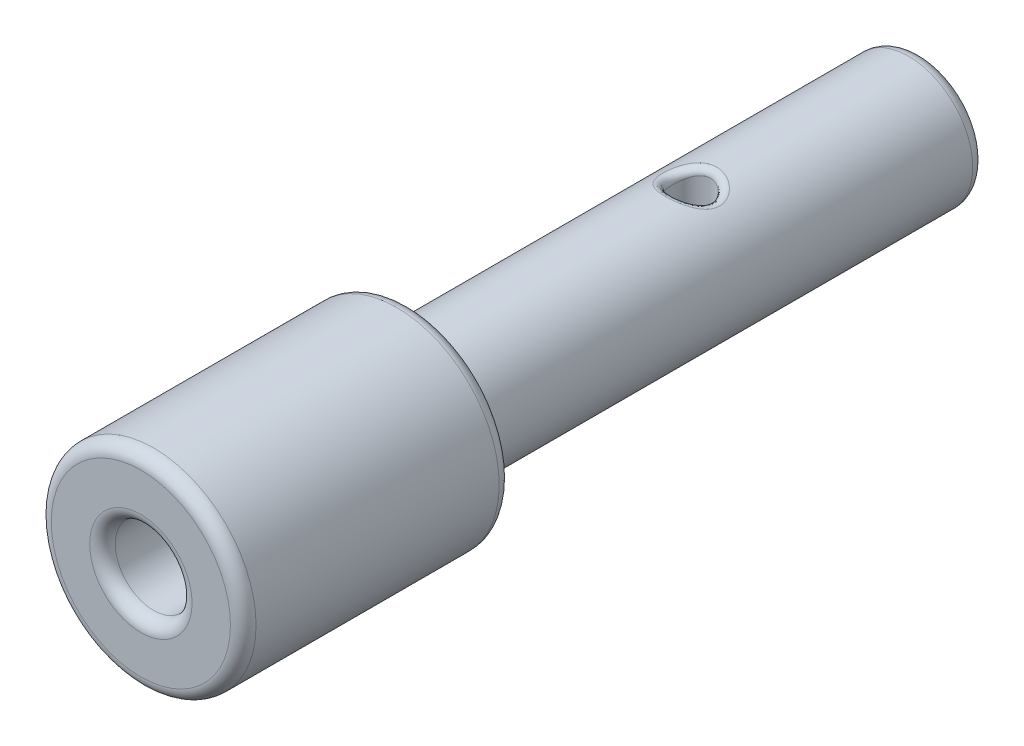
ISO-10303-21;
HEADER;
FILE_DESCRIPTION(('STEP AP214'),'2;1');
FILE_NAME('part.step','',(''),(''),'','','');
FILE_SCHEMA(('AUTOMOTIVE_DESIGN { 1 0 10303 214 1 1 1 1 }'));
ENDSEC;
DATA;
#1=APPLICATION_CONTEXT('core data for automotive mechanical design processes');
#2=APPLICATION_PROTOCOL_DEFINITION('international standard','automotive_design',2000,#1);
#3=PRODUCT_CONTEXT('',#1,'mechanical');
#4=PRODUCT('Part','Part','',(#3));
#5=PRODUCT_RELATED_PRODUCT_CATEGORY('part','',(#4));
#6=PRODUCT_DEFINITION_FORMATION('','',#4);
#7=PRODUCT_DEFINITION_CONTEXT('part definition',#1,'design');
#8=PRODUCT_DEFINITION('design','',#6,#7);
#9=PRODUCT_DEFINITION_SHAPE('','',#8);
#10=(LENGTH_UNIT() NAMED_UNIT(*) SI_UNIT(.MILLI.,.METRE.));
#11=(NAMED_UNIT(*) PLANE_ANGLE_UNIT() SI_UNIT($,.RADIAN.));
#12=(NAMED_UNIT(*) SI_UNIT($,.STERADIAN.) SOLID_ANGLE_UNIT());
#13=UNCERTAINTY_MEASURE_WITH_UNIT(LENGTH_MEASURE(1.E-05),#10,'distance_accuracy_value','');
#14=(GEOMETRIC_REPRESENTATION_CONTEXT(3) GLOBAL_UNCERTAINTY_ASSIGNED_CONTEXT((#13)) GLOBAL_UNIT_ASSIGNED_CONTEXT((#10,
#11,#12)) REPRESENTATION_CONTEXT('',''));
#15=CARTESIAN_POINT('',(0.,0.,0.));
#16=DIRECTION('',(0.,0.,1.));
#17=DIRECTION('',(1.,0.,0.));
#18=AXIS2_PLACEMENT_3D('',#15,#16,#17);
#19=CARTESIAN_POINT('',(0.,4.,0.));
#20=DIRECTION('',(0.,0.,-1.));
#21=DIRECTION('',(-1.,0.,0.));
#22=AXIS2_PLACEMENT_3D('',#19,#20,#21);
#23=PLANE('',#22);
#24=CARTESIAN_POINT('',(0.,0.,0.));
#25=DIRECTION('',(0.,0.,-1.));
#26=DIRECTION('',(-1.,0.,0.));
#27=AXIS2_PLACEMENT_3D('',#24,#25,#26);
#28=CIRCLE('',#27,2.);
#29=CARTESIAN_POINT('',(-2.,0.,0.));
#30=VERTEX_POINT('',#29);
#31=EDGE_CURVE('E116',#30,#30,#28,.T.);
#32=ORIENTED_EDGE('',*,*,#31,.T.);
#33=EDGE_LOOP('',(#32));
#34=FACE_BOUND('',#33,.T.);
#35=CARTESIAN_POINT('',(0.,0.,0.));
#36=DIRECTION('',(0.,0.,-1.));
#37=DIRECTION('',(-1.,0.,0.));
#38=AXIS2_PLACEMENT_3D('',#35,#36,#37);
#39=CIRCLE('',#38,3.5);
#40=CARTESIAN_POINT('',(-3.5,0.,0.));
#41=VERTEX_POINT('',#40);
#42=EDGE_CURVE('E119',#41,#41,#39,.F.);
#43=ORIENTED_EDGE('',*,*,#42,.T.);
#44=EDGE_LOOP('',(#43));
#45=FACE_BOUND('',#44,.T.);
#46=ADVANCED_FACE('F29',(#34,#45),#23,.F.);
#47=CARTESIAN_POINT('',(0.,0.,0.));
#48=DIRECTION('',(0.,0.,1.));
#49=DIRECTION('',(1.,0.,0.));
#50=AXIS2_PLACEMENT_3D('',#47,#48,#49);
#51=CYLINDRICAL_SURFACE('',#50,1.5);
#52=CARTESIAN_POINT('',(0.,0.,-0.500000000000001));
#53=DIRECTION('',(0.,0.,-1.));
#54=DIRECTION('',(-1.,0.,0.));
#55=AXIS2_PLACEMENT_3D('',#52,#53,#54);
#56=CIRCLE('',#55,1.5);
#57=CARTESIAN_POINT('',(-1.5,0.,-0.500000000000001));
#58=VERTEX_POINT('',#57);
#59=EDGE_CURVE('E122',#58,#58,#56,.F.);
#60=ORIENTED_EDGE('',*,*,#59,.T.);
#61=EDGE_LOOP('',(#60));
#62=FACE_BOUND('',#61,.T.);
#63=CARTESIAN_POINT('',(0.,0.,-11.5));
#64=DIRECTION('',(0.,0.,-1.));
#65=DIRECTION('',(-1.,0.,0.));
#66=AXIS2_PLACEMENT_3D('',#63,#64,#65);
#67=CIRCLE('',#66,1.5);
#68=CARTESIAN_POINT('',(-1.5,0.,-11.5));
#69=VERTEX_POINT('',#68);
#70=EDGE_CURVE('E125',#69,#69,#67,.T.);
#71=ORIENTED_EDGE('',*,*,#70,.T.);
#72=EDGE_LOOP('',(#71));
#73=FACE_BOUND('',#72,.T.);
#74=ADVANCED_FACE('F173',(#62,#73),#51,.F.);
#75=CARTESIAN_POINT('',(0.,1.5,-12.));
#76=DIRECTION('',(0.,0.,-1.));
#77=DIRECTION('',(-1.,0.,0.));
#78=AXIS2_PLACEMENT_3D('',#75,#76,#77);
#79=PLANE('',#78);
#80=CARTESIAN_POINT('',(0.,0.,-12.));
#81=DIRECTION('',(0.,0.,-1.));
#82=DIRECTION('',(-1.,0.,0.));
#83=AXIS2_PLACEMENT_3D('',#80,#81,#82);
#84=CIRCLE('',#83,1.);
#85=CARTESIAN_POINT('',(-1.,0.,-12.));
#86=VERTEX_POINT('',#85);
#87=EDGE_CURVE('E113',#86,#86,#84,.F.);
#88=ORIENTED_EDGE('',*,*,#87,.T.);
#89=EDGE_LOOP('',(#88));
#90=FACE_BOUND('',#89,.T.);
#91=ADVANCED_FACE('F179',(#90),#79,.F.);
#92=CARTESIAN_POINT('',(0.,0.,-30.5));
#93=DIRECTION('',(0.,0.,1.));
#94=DIRECTION('',(1.,0.,0.));
#95=AXIS2_PLACEMENT_3D('',#92,#93,#94);
#96=PLANE('',#95);
#97=CARTESIAN_POINT('',(0.,0.,-30.5));
#98=DIRECTION('',(0.,0.,1.));
#99=DIRECTION('',(1.,0.,0.));
#100=AXIS2_PLACEMENT_3D('',#97,#98,#99);
#101=CIRCLE('',#100,2.);
#102=CARTESIAN_POINT('',(2.,0.,-30.5));
#103=VERTEX_POINT('',#102);
#104=EDGE_CURVE('E134',#103,#103,#101,.F.);
#105=ORIENTED_EDGE('',*,*,#104,.T.);
#106=EDGE_LOOP('',(#105));
#107=FACE_BOUND('',#106,.T.);
#108=ADVANCED_FACE('F81',(#107),#96,.F.);
#109=CARTESIAN_POINT('',(0.,0.,0.));
#110=DIRECTION('',(0.,0.,1.));
#111=DIRECTION('',(1.,0.,0.));
#112=AXIS2_PLACEMENT_3D('',#109,#110,#111);
#113=CYLINDRICAL_SURFACE('',#112,2.5);
#114=CARTESIAN_POINT('',(-0.268637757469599,-2.22130692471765,-20.7997616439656));
#115=CARTESIAN_POINT('',(-0.283615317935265,-2.32786211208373,-20.8055075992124));
#116=CARTESIAN_POINT('',(-0.321958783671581,-2.40102835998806,-20.7363134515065));
#117=CARTESIAN_POINT('',(-0.360302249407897,-2.47419460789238,-20.6671193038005));
#118=CARTESIAN_POINT('',(-0.397981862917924,-2.46811880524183,-20.5663488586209));
#119=CARTESIAN_POINT('',(-0.229057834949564,-2.22981604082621,-20.7845779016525));
#120=CARTESIAN_POINT('',(-0.242365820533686,-2.33542958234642,-20.7887141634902));
#121=CARTESIAN_POINT('',(-0.274845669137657,-2.40862473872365,-20.7182397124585));
#122=CARTESIAN_POINT('',(-0.307496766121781,-2.48179184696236,-20.6478315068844));
#123=CARTESIAN_POINT('',(-0.339344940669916,-2.47757337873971,-20.5461038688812));
#124=CARTESIAN_POINT('',(-0.188008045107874,-2.23669656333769,-20.772689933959));
#125=CARTESIAN_POINT('',(-0.199148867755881,-2.34160367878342,-20.7754194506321));
#126=CARTESIAN_POINT('',(-0.225753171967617,-2.41480288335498,-20.7040062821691));
#127=CARTESIAN_POINT('',(-0.252458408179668,-2.48799372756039,-20.6326125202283));
#128=CARTESIAN_POINT('',(-0.278530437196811,-2.48521840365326,-20.5302532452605));
#129=CARTESIAN_POINT('',(-0.104232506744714,-2.24640166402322,-20.7560536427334));
#130=CARTESIAN_POINT('',(-0.110642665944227,-2.35031006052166,-20.7568113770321));
#131=CARTESIAN_POINT('',(-0.12530632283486,-2.42352996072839,-20.684059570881));
#132=CARTESIAN_POINT('',(-0.140072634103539,-2.49674053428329,-20.611328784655));
#133=CARTESIAN_POINT('',(-0.154418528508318,-2.496001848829,-20.5080715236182));
#134=CARTESIAN_POINT('',(-0.0615078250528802,-2.24922878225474,-20.7513008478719));
#135=CARTESIAN_POINT('',(-0.0652834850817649,-2.35285940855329,-20.7514610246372));
#136=CARTESIAN_POINT('',(-0.0739534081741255,-2.42608116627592,-20.6783409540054));
#137=CARTESIAN_POINT('',(-0.0826355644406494,-2.49930259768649,-20.6052216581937));
#138=CARTESIAN_POINT('',(-0.0911227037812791,-2.49914309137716,-20.5017344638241));
#139=CARTESIAN_POINT('',(0.0207336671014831,-2.25044501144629,-20.7492496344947));
#140=CARTESIAN_POINT('',(0.0219975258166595,-2.35395378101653,-20.7491573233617));
#141=CARTESIAN_POINT('',(0.0249279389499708,-2.42717805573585,-20.6758743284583));
#142=CARTESIAN_POINT('',(0.0278457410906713,-2.50040236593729,-20.6025912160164));
#143=CARTESIAN_POINT('',(0.0307165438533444,-2.50049445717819,-20.4989995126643));
#144=CARTESIAN_POINT('',(0.0602347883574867,-2.24916983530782,-20.7513873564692));
#145=CARTESIAN_POINT('',(0.0639713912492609,-2.35280351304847,-20.7515650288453));
#146=CARTESIAN_POINT('',(0.0724350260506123,-2.42602673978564,-20.6784477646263));
#147=CARTESIAN_POINT('',(0.0809590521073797,-2.49924630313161,-20.6053386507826));
#148=CARTESIAN_POINT('',(0.0892367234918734,-2.49907759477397,-20.5018498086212));
#149=CARTESIAN_POINT('',(0.138253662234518,-2.24304116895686,-20.7618031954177));
#150=CARTESIAN_POINT('',(0.146602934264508,-2.34729722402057,-20.7632393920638));
#151=CARTESIAN_POINT('',(0.166123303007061,-2.4205071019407,-20.690955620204));
#152=CARTESIAN_POINT('',(0.185702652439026,-2.49371361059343,-20.6186796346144));
#153=CARTESIAN_POINT('',(0.204820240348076,-2.49226796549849,-20.5157375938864));
#154=CARTESIAN_POINT('',(0.176771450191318,-2.23818780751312,-20.7700810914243));
#155=CARTESIAN_POINT('',(0.187320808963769,-2.34293310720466,-20.7725232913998));
#156=CARTESIAN_POINT('',(0.212304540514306,-2.41613889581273,-20.7008897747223));
#157=CARTESIAN_POINT('',(0.237409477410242,-2.48932884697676,-20.6292928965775));
#158=CARTESIAN_POINT('',(0.261883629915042,-2.48687534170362,-20.5267747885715));
#159=CARTESIAN_POINT('',(0.251251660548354,-2.22547713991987,-20.7922831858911));
#160=CARTESIAN_POINT('',(0.265570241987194,-2.33156716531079,-20.7972467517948));
#161=CARTESIAN_POINT('',(0.301302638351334,-2.40474788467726,-20.7274194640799));
#162=CARTESIAN_POINT('',(0.337152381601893,-2.47791390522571,-20.6576266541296));
#163=CARTESIAN_POINT('',(0.372224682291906,-2.47275237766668,-20.5563775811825));
#164=CARTESIAN_POINT('',(0.287241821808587,-2.21766181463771,-20.8061286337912));
#165=CARTESIAN_POINT('',(0.303183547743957,-2.32458747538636,-20.8126335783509));
#166=CARTESIAN_POINT('',(0.344156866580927,-2.39776219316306,-20.7439220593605));
#167=CARTESIAN_POINT('',(0.385288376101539,-2.47090591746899,-20.675286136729));
#168=CARTESIAN_POINT('',(0.425543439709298,-2.46406868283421,-20.574838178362));
#169=CARTESIAN_POINT('',(0.356484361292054,-2.19972637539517,-20.8390220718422));
#170=CARTESIAN_POINT('',(0.374907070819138,-2.30868189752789,-20.8488487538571));
#171=CARTESIAN_POINT('',(0.426174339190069,-2.38182901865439,-20.7828841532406));
#172=CARTESIAN_POINT('',(0.477601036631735,-2.45494543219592,-20.7169948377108));
#173=CARTESIAN_POINT('',(0.528124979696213,-2.44414041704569,-20.6186960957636));
#174=CARTESIAN_POINT('',(0.38973117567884,-2.18960172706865,-20.8580803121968));
#175=CARTESIAN_POINT('',(0.409034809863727,-2.2997360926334,-20.8697283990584));
#176=CARTESIAN_POINT('',(0.46533010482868,-2.37287767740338,-20.8053553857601));
#177=CARTESIAN_POINT('',(0.521803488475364,-2.44597299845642,-20.7411038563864));
#178=CARTESIAN_POINT('',(0.577379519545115,-2.43289080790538,-20.6441070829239));
#179=CARTESIAN_POINT('',(0.454891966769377,-2.16720476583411,-20.9023155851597));
#180=CARTESIAN_POINT('',(0.475136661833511,-2.28011700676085,-20.9176212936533));
#181=CARTESIAN_POINT('',(0.541507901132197,-2.35324021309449,-20.8570700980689));
#182=CARTESIAN_POINT('',(0.608082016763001,-2.42631150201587,-20.7966560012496));
#183=CARTESIAN_POINT('',(0.673914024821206,-2.40800529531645,-20.7030874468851));
#184=CARTESIAN_POINT('',(0.486565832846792,-2.15483379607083,-20.9278179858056));
#185=CARTESIAN_POINT('',(0.506804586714,-2.26935646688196,-20.9449918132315));
#186=CARTESIAN_POINT('',(0.578209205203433,-2.34247789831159,-20.8866674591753));
#187=CARTESIAN_POINT('',(0.649809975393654,-2.41553608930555,-20.8285300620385));
#188=CARTESIAN_POINT('',(0.720838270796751,-2.39425977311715,-20.737090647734));
#189=CARTESIAN_POINT('',(0.545348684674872,-2.12966590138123,-20.9835349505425));
#190=CARTESIAN_POINT('',(0.564629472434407,-2.24771406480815,-21.0038329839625));
#191=CARTESIAN_POINT('',(0.645616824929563,-2.32083282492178,-20.9505590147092));
#192=CARTESIAN_POINT('',(0.726802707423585,-2.3938880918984,-20.8974721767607));
#193=CARTESIAN_POINT('',(0.807923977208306,-2.36629544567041,-20.8113799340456));
#194=CARTESIAN_POINT('',(0.572456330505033,-2.11686885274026,-21.0137508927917));
#195=CARTESIAN_POINT('',(0.590764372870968,-2.236826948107,-21.0353412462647));
#196=CARTESIAN_POINT('',(0.676321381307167,-2.30995003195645,-20.9848545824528));
#197=CARTESIAN_POINT('',(0.762043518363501,-2.38301040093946,-20.9345867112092));
#198=CARTESIAN_POINT('',(0.84808345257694,-2.35207650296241,-20.8516678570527));
#199=CARTESIAN_POINT('',(0.623131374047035,-2.09131323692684,-21.0803921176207));
#200=CARTESIAN_POINT('',(0.638693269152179,-2.21536645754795,-21.1035200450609));
#201=CARTESIAN_POINT('',(0.732988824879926,-2.28851754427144,-21.0593758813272));
#202=CARTESIAN_POINT('',(0.827473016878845,-2.36159756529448,-21.0154780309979));
#203=CARTESIAN_POINT('',(0.923157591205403,-2.32368137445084,-20.9405228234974));
#204=CARTESIAN_POINT('',(0.646354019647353,-2.07861126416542,-21.117093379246));
#205=CARTESIAN_POINT('',(0.660038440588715,-2.2048730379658,-21.1403938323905));
#206=CARTESIAN_POINT('',(0.758513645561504,-2.27803550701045,-21.0998421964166));
#207=CARTESIAN_POINT('',(0.857113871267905,-2.35114438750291,-21.0595358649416));
#208=CARTESIAN_POINT('',(0.957561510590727,-2.30956807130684,-20.9894578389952));
#209=CARTESIAN_POINT('',(0.686250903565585,-2.05575185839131,-21.1943108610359));
#210=CARTESIAN_POINT('',(0.695931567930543,-2.18625434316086,-21.2162464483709));
#211=CARTESIAN_POINT('',(0.801723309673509,-2.25946768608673,-21.1834642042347));
#212=CARTESIAN_POINT('',(0.907643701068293,-2.33262561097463,-21.1509275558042));
#213=CARTESIAN_POINT('',(1.01666800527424,-2.28416873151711,-21.09241448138));
#214=CARTESIAN_POINT('',(0.702927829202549,-2.04559338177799,-21.2348255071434));
#215=CARTESIAN_POINT('',(0.710423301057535,-2.17815187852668,-21.2551968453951));
#216=CARTESIAN_POINT('',(0.81941137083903,-2.25138091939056,-21.2266187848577));
#217=CARTESIAN_POINT('',(0.928458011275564,-2.32458287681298,-21.1982312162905));
#218=CARTESIAN_POINT('',(1.04137456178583,-2.2728815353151,-21.1464340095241));
#219=CARTESIAN_POINT('',(0.728531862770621,-2.02959949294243,-21.3169265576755));
#220=CARTESIAN_POINT('',(0.732313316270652,-2.16552409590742,-21.3325844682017));
#221=CARTESIAN_POINT('',(0.846248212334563,-2.23880721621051,-21.3126587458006));
#222=CARTESIAN_POINT('',(0.960239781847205,-2.31206343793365,-21.2929121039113));
#223=CARTESIAN_POINT('',(1.07930646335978,-2.25511054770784,-21.255902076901));
#224=CARTESIAN_POINT('',(0.737737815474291,-2.02360985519,-21.3584082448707));
#225=CARTESIAN_POINT('',(0.739922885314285,-2.16089467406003,-21.3709202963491));
#226=CARTESIAN_POINT('',(0.855705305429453,-2.23419128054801,-21.355488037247));
#227=CARTESIAN_POINT('',(0.971498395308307,-2.30748284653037,-21.3401410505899));
#228=CARTESIAN_POINT('',(1.09294491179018,-2.24845539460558,-21.3112109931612));
#229=CARTESIAN_POINT('',(0.748996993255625,-2.01624594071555,-21.4425449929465));
#230=CARTESIAN_POINT('',(0.749208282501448,-2.15520643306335,-21.4479398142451));
#231=CARTESIAN_POINT('',(0.867235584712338,-2.22853464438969,-21.4416216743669));
#232=CARTESIAN_POINT('',(0.98527566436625,-2.30185639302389,-21.4353934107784));
#233=CARTESIAN_POINT('',(1.10962517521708,-2.24027326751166,-21.4233933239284));
#234=CARTESIAN_POINT('',(0.751055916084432,-2.01486798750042,-21.4851990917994));
#235=CARTESIAN_POINT('',(0.750865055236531,-2.15415920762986,-21.4865267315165));
#236=CARTESIAN_POINT('',(0.869314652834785,-2.22749109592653,-21.4849256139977));
#237=CARTESIAN_POINT('',(0.987766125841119,-2.30082200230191,-21.4832975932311));
#238=CARTESIAN_POINT('',(1.11267543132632,-2.2387422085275,-21.4802654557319));
#239=CARTESIAN_POINT('',(0.748070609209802,-2.01683862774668,-21.5661361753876));
#240=CARTESIAN_POINT('',(0.748422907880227,-2.15567407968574,-21.5600715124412));
#241=CARTESIAN_POINT('',(0.866273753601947,-2.22899679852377,-21.5672949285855));
#242=CARTESIAN_POINT('',(0.984124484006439,-2.30231962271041,-21.5744998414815));
#243=CARTESIAN_POINT('',(1.10825275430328,-2.24093180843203,-21.5881815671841));
#244=CARTESIAN_POINT('',(0.743679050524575,-2.0197529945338,-21.6044514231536));
#245=CARTESIAN_POINT('',(0.744858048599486,-2.15790136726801,-21.5949449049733));
#246=CARTESIAN_POINT('',(0.861815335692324,-2.23121594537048,-21.6063742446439));
#247=CARTESIAN_POINT('',(0.978792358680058,-2.30452080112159,-21.617702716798));
#248=CARTESIAN_POINT('',(1.10174674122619,-2.24416999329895,-21.6392685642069));
#249=CARTESIAN_POINT('',(0.729156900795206,-2.02914353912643,-21.6797215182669));
#250=CARTESIAN_POINT('',(0.732766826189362,-2.16519669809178,-21.6643988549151));
#251=CARTESIAN_POINT('',(0.84685161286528,-2.23847347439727,-21.6839226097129));
#252=CARTESIAN_POINT('',(0.960955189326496,-2.31174128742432,-21.7033475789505));
#253=CARTESIAN_POINT('',(1.08023244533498,-2.25460393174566,-21.7396286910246));
#254=CARTESIAN_POINT('',(0.719025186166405,-2.03562041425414,-21.7166760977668));
#255=CARTESIAN_POINT('',(0.724263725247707,-2.17025106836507,-21.698914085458));
#256=CARTESIAN_POINT('',(0.836345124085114,-2.24351240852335,-21.7223915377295));
#257=CARTESIAN_POINT('',(0.948484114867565,-2.31674704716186,-21.7457099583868));
#258=CARTESIAN_POINT('',(1.06522249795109,-2.26180046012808,-21.7889014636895));
#259=CARTESIAN_POINT('',(0.693325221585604,-2.05140867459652,-21.7885628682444));
#260=CARTESIAN_POINT('',(0.702040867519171,-2.18280294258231,-21.7673039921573));
#261=CARTESIAN_POINT('',(0.809211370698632,-2.25601445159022,-21.7982813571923));
#262=CARTESIAN_POINT('',(0.916438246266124,-2.32920015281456,-21.8290990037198));
#263=CARTESIAN_POINT('',(1.02714847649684,-2.27934297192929,-21.8847504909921));
#264=CARTESIAN_POINT('',(0.677719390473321,-2.06073959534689,-21.8234790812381));
#265=CARTESIAN_POINT('',(0.68832160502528,-2.1902987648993,-21.801130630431));
#266=CARTESIAN_POINT('',(0.792541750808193,-2.26349429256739,-21.8356930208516));
#267=CARTESIAN_POINT('',(0.896865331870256,-2.33664587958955,-21.8700655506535));
#268=CARTESIAN_POINT('',(1.00402872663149,-2.28971066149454,-21.9313054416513));
#269=CARTESIAN_POINT('',(0.641559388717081,-2.08121453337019,-21.8903160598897));
#270=CARTESIAN_POINT('',(0.655606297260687,-2.20703279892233,-21.8670921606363));
#271=CARTESIAN_POINT('',(0.753236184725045,-2.2801861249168,-21.9083418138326));
#272=CARTESIAN_POINT('',(0.850968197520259,-2.35329609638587,-21.9494013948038));
#273=CARTESIAN_POINT('',(0.95045835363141,-2.31246059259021,-22.0204214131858));
#274=CARTESIAN_POINT('',(0.621003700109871,-2.09235910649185,-21.9222359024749));
#275=CARTESIAN_POINT('',(0.636647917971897,-2.21625642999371,-21.8992115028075));
#276=CARTESIAN_POINT('',(0.730598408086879,-2.28939864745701,-21.9435782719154));
#277=CARTESIAN_POINT('',(0.824693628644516,-2.36248595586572,-21.9877547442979));
#278=CARTESIAN_POINT('',(0.920005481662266,-2.32484345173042,-22.0629812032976));
#279=CARTESIAN_POINT('',(0.57321975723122,-2.11651207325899,-21.9854223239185));
#280=CARTESIAN_POINT('',(0.591504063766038,-2.23652245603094,-21.9637907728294));
#281=CARTESIAN_POINT('',(0.677186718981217,-2.30964664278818,-22.0142047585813));
#282=CARTESIAN_POINT('',(0.763040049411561,-2.38270617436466,-22.0643918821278));
#283=CARTESIAN_POINT('',(0.849214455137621,-2.35168008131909,-22.1472297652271));
#284=CARTESIAN_POINT('',(0.545540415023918,-2.12959668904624,-22.0163321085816));
#285=CARTESIAN_POINT('',(0.564826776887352,-2.24765226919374,-21.9960189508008));
#286=CARTESIAN_POINT('',(0.645840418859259,-2.32077221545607,-22.0492848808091));
#287=CARTESIAN_POINT('',(0.727060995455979,-2.39382617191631,-22.1023563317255));
#288=CARTESIAN_POINT('',(0.808208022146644,-2.36621854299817,-22.1884428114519));
#289=CARTESIAN_POINT('',(0.485386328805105,-2.15532572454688,-22.0732504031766));
#290=CARTESIAN_POINT('',(0.50564333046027,-2.26977894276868,-22.0561366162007));
#291=CARTESIAN_POINT('',(0.576852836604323,-2.34290208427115,-22.1145614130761));
#292=CARTESIAN_POINT('',(0.648268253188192,-2.41595878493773,-22.1727900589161));
#293=CARTESIAN_POINT('',(0.719090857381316,-2.39480636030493,-22.2643338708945));
#294=CARTESIAN_POINT('',(0.452907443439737,-2.16796975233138,-22.0992546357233));
#295=CARTESIAN_POINT('',(0.473153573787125,-2.28078144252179,-22.0840616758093));
#296=CARTESIAN_POINT('',(0.539206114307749,-2.35390626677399,-22.1447535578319));
#297=CARTESIAN_POINT('',(0.605471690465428,-2.42697691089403,-22.2053031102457));
#298=CARTESIAN_POINT('',(0.670973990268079,-2.40885528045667,-22.2990061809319));
#299=CARTESIAN_POINT('',(0.382333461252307,-2.19205063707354,-22.1466891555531));
#300=CARTESIAN_POINT('',(0.401525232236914,-2.30187957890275,-22.135435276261));
#301=CARTESIAN_POINT('',(0.456660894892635,-2.37503020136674,-22.2002341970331));
#302=CARTESIAN_POINT('',(0.512026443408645,-2.44812164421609,-22.2648777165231));
#303=CARTESIAN_POINT('',(0.566419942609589,-2.43561181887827,-22.362252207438));
#304=CARTESIAN_POINT('',(0.344055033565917,-2.20341065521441,-22.1678700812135));
#305=CARTESIAN_POINT('',(0.362143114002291,-2.3119357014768,-22.1586995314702));
#306=CARTESIAN_POINT('',(0.411517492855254,-2.38509033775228,-22.2252509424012));
#307=CARTESIAN_POINT('',(0.461091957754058,-2.45820932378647,-22.2917154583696));
#308=CARTESIAN_POINT('',(0.509711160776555,-2.44823406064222,-22.3904934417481));
#309=CARTESIAN_POINT('',(0.264086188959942,-2.22293257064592,-22.2033207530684));
#310=CARTESIAN_POINT('',(0.279069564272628,-2.32927652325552,-22.1978189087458));
#311=CARTESIAN_POINT('',(0.31662548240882,-2.40246337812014,-22.2673165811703));
#312=CARTESIAN_POINT('',(0.354379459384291,-2.47561299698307,-22.3367246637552));
#313=CARTESIAN_POINT('',(0.391238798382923,-2.46992507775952,-22.4377610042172));
#314=CARTESIAN_POINT('',(0.222406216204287,-2.23110384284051,-22.2176107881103));
#315=CARTESIAN_POINT('',(0.235349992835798,-2.33659321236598,-22.2137544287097));
#316=CARTESIAN_POINT('',(0.266890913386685,-2.40978433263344,-22.2843888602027));
#317=CARTESIAN_POINT('',(0.298560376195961,-2.48296102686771,-22.3549896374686));
#318=CARTESIAN_POINT('',(0.329490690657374,-2.47900426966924,-22.4568143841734));
#319=CARTESIAN_POINT('',(0.154316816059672,-2.24083333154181,-22.2344201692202));
#320=CARTESIAN_POINT('',(0.163555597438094,-2.34531503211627,-22.2325327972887));
#321=CARTESIAN_POINT('',(0.185374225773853,-2.41852094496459,-22.3045145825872));
#322=CARTESIAN_POINT('',(0.207240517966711,-2.49172213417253,-22.3764857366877));
#323=CARTESIAN_POINT('',(0.228617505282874,-2.48981481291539,-22.479226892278));
#324=CARTESIAN_POINT('',(0.128583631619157,-2.24372952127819,-22.2393629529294));
#325=CARTESIAN_POINT('',(0.136343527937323,-2.34791705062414,-22.2380710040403));
#326=CARTESIAN_POINT('',(0.154508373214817,-2.42112738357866,-22.3104455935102));
#327=CARTESIAN_POINT('',(0.172701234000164,-2.49433644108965,-22.3828173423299));
#328=CARTESIAN_POINT('',(0.190494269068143,-2.49303280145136,-22.4858172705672));
#329=CARTESIAN_POINT('',(0.0638971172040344,-2.24897717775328,-22.2482904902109));
#330=CARTESIAN_POINT('',(0.0678552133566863,-2.35262966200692,-22.248071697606));
#331=CARTESIAN_POINT('',(0.0768365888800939,-2.42585275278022,-22.3211641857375));
#332=CARTESIAN_POINT('',(0.0858776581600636,-2.4990715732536,-22.3942469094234));
#333=CARTESIAN_POINT('',(0.0946623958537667,-2.49886353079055,-22.4977206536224));
#334=CARTESIAN_POINT('',(0.0246508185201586,-2.25036456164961,-22.2506159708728));
#335=CARTESIAN_POINT('',(0.0261570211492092,-2.35388118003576,-22.2506911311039));
#336=CARTESIAN_POINT('',(0.0296385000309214,-2.42710538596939,-22.3239637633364));
#337=CARTESIAN_POINT('',(0.0331097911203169,-2.50032939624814,-22.3972359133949));
#338=CARTESIAN_POINT('',(0.0365197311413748,-2.50040506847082,-22.5008212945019));
#339=CARTESIAN_POINT('',(-0.0537554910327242,-2.24946811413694,-22.2491016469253));
#340=CARTESIAN_POINT('',(-0.0570549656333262,-2.35307500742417,-22.2489916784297));
#341=CARTESIAN_POINT('',(-0.0646332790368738,-2.4262971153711,-22.322143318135));
#342=CARTESIAN_POINT('',(-0.0722189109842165,-2.4995192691,-22.3952951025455));
#343=CARTESIAN_POINT('',(-0.0796377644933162,-2.49940901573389,-22.4988021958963));
#344=CARTESIAN_POINT('',(-0.0929152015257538,-2.24717738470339,-22.245250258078));
#345=CARTESIAN_POINT('',(-0.0986316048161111,-2.35100986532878,-22.244657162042));
#346=CARTESIAN_POINT('',(-0.111706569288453,-2.42422998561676,-22.3175093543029));
#347=CARTESIAN_POINT('',(-0.124859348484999,-2.497443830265,-22.3903474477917));
#348=CARTESIAN_POINT('',(-0.137652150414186,-2.496863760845,-22.4936670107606));
#349=CARTESIAN_POINT('',(-0.169838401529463,-2.23916446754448,-22.2315572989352));
#350=CARTESIAN_POINT('',(-0.179971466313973,-2.34381752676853,-22.2293297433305));
#351=CARTESIAN_POINT('',(-0.203988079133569,-2.41702049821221,-22.3010824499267));
#352=CARTESIAN_POINT('',(-0.228081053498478,-2.49021770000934,-22.3728218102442));
#353=CARTESIAN_POINT('',(-0.251612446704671,-2.4879605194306,-22.4754097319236));
#354=CARTESIAN_POINT('',(-0.207605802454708,-2.23345281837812,-22.221734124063));
#355=CARTESIAN_POINT('',(-0.219795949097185,-2.33868941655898,-22.2183350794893));
#356=CARTESIAN_POINT('',(-0.249201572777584,-2.41188758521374,-22.2893114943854));
#357=CARTESIAN_POINT('',(-0.278739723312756,-2.48506608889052,-22.3602418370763));
#358=CARTESIAN_POINT('',(-0.307564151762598,-2.4816142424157,-22.4623121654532));
#359=CARTESIAN_POINT('',(-0.280940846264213,-2.21915135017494,-22.1964767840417));
#360=CARTESIAN_POINT('',(-0.29659560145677,-2.32592470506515,-22.1902813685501));
#361=CARTESIAN_POINT('',(-0.336657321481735,-2.39909632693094,-22.2591909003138));
#362=CARTESIAN_POINT('',(-0.376851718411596,-2.47224882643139,-22.3280551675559));
#363=CARTESIAN_POINT('',(-0.416208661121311,-2.46572372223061,-22.4286357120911));
#364=CARTESIAN_POINT('',(-0.316504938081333,-2.21055702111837,-22.1810338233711));
#365=CARTESIAN_POINT('',(-0.33360608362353,-2.31826844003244,-22.1731765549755));
#366=CARTESIAN_POINT('',(-0.378894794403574,-2.39143402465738,-22.2408309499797));
#367=CARTESIAN_POINT('',(-0.424352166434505,-2.46456345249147,-22.3083956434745));
#368=CARTESIAN_POINT('',(-0.468896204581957,-2.45617446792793,-22.4080450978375));
#369=CARTESIAN_POINT('',(-0.385632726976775,-2.19098389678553,-22.1444864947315));
#370=CARTESIAN_POINT('',(-0.404845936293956,-2.30096251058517,-22.1331028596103));
#371=CARTESIAN_POINT('',(-0.460514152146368,-2.37410173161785,-22.1976792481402));
#372=CARTESIAN_POINT('',(-0.516361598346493,-2.44720324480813,-22.2621614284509));
#373=CARTESIAN_POINT('',(-0.571307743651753,-2.43442655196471,-22.359315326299));
#374=CARTESIAN_POINT('',(-0.419101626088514,-2.17994005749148,-22.1232230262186));
#375=CARTESIAN_POINT('',(-0.438971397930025,-2.29124282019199,-22.1099272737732));
#376=CARTESIAN_POINT('',(-0.499768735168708,-2.36437737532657,-22.1727075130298));
#377=CARTESIAN_POINT('',(-0.560757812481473,-2.43745852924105,-22.2353429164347));
#378=CARTESIAN_POINT('',(-0.620891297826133,-2.42215561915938,-22.3309640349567));
#379=CARTESIAN_POINT('',(-0.482148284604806,-2.15664817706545,-22.0758385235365));
#380=CARTESIAN_POINT('',(-0.502400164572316,-2.27094163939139,-22.0589690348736));
#381=CARTESIAN_POINT('',(-0.573099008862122,-2.34405935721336,-22.1175942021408));
#382=CARTESIAN_POINT('',(-0.64399153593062,-2.41712368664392,-22.1760745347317));
#383=CARTESIAN_POINT('',(-0.714293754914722,-2.39627575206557,-22.2677846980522));
#384=CARTESIAN_POINT('',(-0.511723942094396,-2.14439949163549,-22.0497148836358));
#385=CARTESIAN_POINT('',(-0.531697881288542,-2.26034791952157,-22.0311414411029));
#386=CARTESIAN_POINT('',(-0.607171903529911,-2.33346523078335,-22.0874498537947));
#387=CARTESIAN_POINT('',(-0.682826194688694,-2.40652141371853,-22.1435708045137));
#388=CARTESIAN_POINT('',(-0.758109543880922,-2.38266610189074,-22.2329531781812));
#389=CARTESIAN_POINT('',(-0.568626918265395,-2.11882254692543,-21.9908868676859));
#390=CARTESIAN_POINT('',(-0.587143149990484,-2.23847815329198,-21.9694876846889));
#391=CARTESIAN_POINT('',(-0.672021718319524,-2.31160413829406,-22.0204057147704));
#392=CARTESIAN_POINT('',(-0.757111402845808,-2.38465934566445,-22.0711066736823));
#393=CARTESIAN_POINT('',(-0.84241024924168,-2.35424727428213,-22.1545158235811));
#394=CARTESIAN_POINT('',(-0.595580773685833,-2.10548686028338,-21.9578217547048));
#395=CARTESIAN_POINT('',(-0.612803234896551,-2.22721931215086,-21.9353393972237));
#396=CARTESIAN_POINT('',(-0.702311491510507,-2.3003517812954,-21.9831572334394));
#397=CARTESIAN_POINT('',(-0.791984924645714,-2.3734189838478,-22.0307307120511));
#398=CARTESIAN_POINT('',(-0.88234188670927,-2.33942984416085,-22.1104290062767));
#399=CARTESIAN_POINT('',(-0.643576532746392,-2.0802272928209,-21.8874528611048));
#400=CARTESIAN_POINT('',(-0.657550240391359,-2.20619337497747,-21.8641848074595));
#401=CARTESIAN_POINT('',(-0.755497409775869,-2.27935900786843,-21.9051812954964));
#402=CARTESIAN_POINT('',(-0.853612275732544,-2.35245852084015,-21.9459341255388));
#403=CARTESIAN_POINT('',(-0.953446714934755,-2.31136365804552,-22.0166038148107));
#404=CARTESIAN_POINT('',(-0.664628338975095,-2.06830106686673,-21.8501563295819));
#405=CARTESIAN_POINT('',(-0.67659808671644,-2.19643731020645,-21.8271795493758));
#406=CARTESIAN_POINT('',(-0.778405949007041,-2.26961607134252,-21.8644598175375));
#407=CARTESIAN_POINT('',(-0.880316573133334,-2.34274956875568,-21.9015118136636));
#408=CARTESIAN_POINT('',(-0.984634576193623,-2.29811229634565,-21.9668751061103));
#409=CARTESIAN_POINT('',(-0.700290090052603,-2.0472785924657,-21.7719350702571));
#410=CARTESIAN_POINT('',(-0.708210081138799,-2.17946868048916,-21.7512542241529));
#411=CARTESIAN_POINT('',(-0.816662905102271,-2.25270193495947,-21.7805535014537));
#412=CARTESIAN_POINT('',(-0.925222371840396,-2.32588786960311,-21.8096218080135));
#413=CARTESIAN_POINT('',(-1.03746680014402,-2.27475399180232,-21.8625800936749));
#414=CARTESIAN_POINT('',(-0.714868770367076,-2.03819614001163,-21.7309938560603));
#415=CARTESIAN_POINT('',(-0.720685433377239,-2.17229408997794,-21.7123665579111));
#416=CARTESIAN_POINT('',(-0.831974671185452,-2.24554324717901,-21.7373578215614));
#417=CARTESIAN_POINT('',(-0.943305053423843,-2.3187731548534,-21.762185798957));
#418=CARTESIAN_POINT('',(-1.05906484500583,-2.26466237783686,-21.8079918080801));
#419=CARTESIAN_POINT('',(-0.736765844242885,-2.02428956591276,-21.6468380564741));
#420=CARTESIAN_POINT('',(-0.739182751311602,-2.16139383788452,-21.6338177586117));
#421=CARTESIAN_POINT('',(-0.854747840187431,-2.23469513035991,-21.6498586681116));
#422=CARTESIAN_POINT('',(-0.970357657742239,-2.30797476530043,-21.6657329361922));
#423=CARTESIAN_POINT('',(-1.09150495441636,-2.24921062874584,-21.6957840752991));
#424=CARTESIAN_POINT('',(-0.744091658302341,-2.01946109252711,-21.6036258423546));
#425=CARTESIAN_POINT('',(-0.745166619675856,-2.15768965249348,-21.5942408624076));
#426=CARTESIAN_POINT('',(-0.862217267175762,-2.23100215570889,-21.6055563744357));
#427=CARTESIAN_POINT('',(-0.979272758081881,-2.30431240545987,-21.6168177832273));
#428=CARTESIAN_POINT('',(-1.10235801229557,-2.24384565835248,-21.6381677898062));
#429=CARTESIAN_POINT('',(-0.750767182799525,-2.01506158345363,-21.5205252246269));
#430=CARTESIAN_POINT('',(-0.750633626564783,-2.15430581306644,-21.5185574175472));
#431=CARTESIAN_POINT('',(-0.869023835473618,-2.22763722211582,-21.5208255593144));
#432=CARTESIAN_POINT('',(-0.987417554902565,-2.30096676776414,-21.5230443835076));
#433=CARTESIAN_POINT('',(-1.11224767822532,-2.23895731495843,-21.5273669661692));
#434=CARTESIAN_POINT('',(-0.750798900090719,-2.01504100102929,-21.4807040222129));
#435=CARTESIAN_POINT('',(-0.750659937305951,-2.15428988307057,-21.482555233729));
#436=CARTESIAN_POINT('',(-0.869056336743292,-2.2276214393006,-21.4804223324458));
#437=CARTESIAN_POINT('',(-0.987456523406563,-2.30095101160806,-21.4783368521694));
#438=CARTESIAN_POINT('',(-1.11229466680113,-2.23893444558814,-21.4742720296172));
#439=CARTESIAN_POINT('',(-0.744582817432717,-2.0191370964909,-21.4016799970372));
#440=CARTESIAN_POINT('',(-0.74556807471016,-2.15744084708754,-21.4105927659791));
#441=CARTESIAN_POINT('',(-0.862717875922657,-2.23075442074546,-21.3998586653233));
#442=CARTESIAN_POINT('',(-0.979871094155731,-2.30406641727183,-21.3891687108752));
#443=CARTESIAN_POINT('',(-1.10308565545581,-2.24348566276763,-21.3689066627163));
#444=CARTESIAN_POINT('',(-0.738335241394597,-2.02325362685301,-21.3624771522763));
#445=CARTESIAN_POINT('',(-0.740461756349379,-2.16060040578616,-21.374714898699));
#446=CARTESIAN_POINT('',(-0.856347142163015,-2.23390307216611,-21.3596982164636));
#447=CARTESIAN_POINT('',(-0.972264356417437,-2.30719032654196,-21.3448099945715));
#448=CARTESIAN_POINT('',(-1.09382998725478,-2.24805958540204,-21.3166362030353));
#449=CARTESIAN_POINT('',(-0.720228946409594,-2.03481726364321,-21.2873901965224));
#450=CARTESIAN_POINT('',(-0.725233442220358,-2.16963964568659,-21.304868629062));
#451=CARTESIAN_POINT('',(-0.83756996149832,-2.2428975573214,-21.2818430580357));
#452=CARTESIAN_POINT('',(-0.949933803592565,-2.31614253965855,-21.2589341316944));
#453=CARTESIAN_POINT('',(-1.06700584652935,-2.26090807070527,-21.2165202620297));
#454=CARTESIAN_POINT('',(-0.708606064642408,-2.04212372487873,-21.2514360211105));
#455=CARTESIAN_POINT('',(-0.715350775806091,-2.17538813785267,-21.2709443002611));
#456=CARTESIAN_POINT('',(-0.825416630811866,-2.24862979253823,-21.2441141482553));
#457=CARTESIAN_POINT('',(-0.935550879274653,-2.3218404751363,-21.217450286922));
#458=CARTESIAN_POINT('',(-1.04978676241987,-2.26902636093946,-21.16858136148));
#459=CARTESIAN_POINT('',(-0.680260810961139,-2.05918745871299,-21.1819522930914));
#460=CARTESIAN_POINT('',(-0.690526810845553,-2.18905970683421,-21.204153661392));
#461=CARTESIAN_POINT('',(-0.795244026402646,-2.26225267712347,-21.1701550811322));
#462=CARTESIAN_POINT('',(-0.900028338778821,-2.33541544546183,-21.1363223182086));
#463=CARTESIAN_POINT('',(-1.00779379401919,-2.28798606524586,-21.0759363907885));
#464=CARTESIAN_POINT('',(-0.663536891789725,-2.0689454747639,-21.148423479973));
#465=CARTESIAN_POINT('',(-0.6756206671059,-2.19696597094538,-21.1713207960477));
#466=CARTESIAN_POINT('',(-0.777222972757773,-2.27014398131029,-21.1339253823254));
#467=CARTESIAN_POINT('',(-0.878937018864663,-2.34327570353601,-21.0967165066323));
#468=CARTESIAN_POINT('',(-0.983017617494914,-2.29882830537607,-21.0312313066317));
#469=CARTESIAN_POINT('',(-0.623930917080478,-2.09076692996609,-21.081878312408));
#470=CARTESIAN_POINT('',(-0.639354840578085,-2.21493069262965,-21.1050089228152));
#471=CARTESIAN_POINT('',(-0.733832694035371,-2.28807376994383,-21.0610247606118));
#472=CARTESIAN_POINT('',(-0.828437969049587,-2.36116431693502,-21.0172559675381));
#473=CARTESIAN_POINT('',(-0.924342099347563,-2.32307436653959,-20.9425044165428));
#474=CARTESIAN_POINT('',(-0.600666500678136,-2.10295165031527,-21.0491120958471));
#475=CARTESIAN_POINT('',(-0.617613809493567,-2.22509886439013,-21.0716781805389));
#476=CARTESIAN_POINT('',(-0.70799512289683,-2.29823269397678,-21.0245454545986));
#477=CARTESIAN_POINT('',(-0.798550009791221,-2.37130381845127,-20.9776187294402));
#478=CARTESIAN_POINT('',(-0.889876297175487,-2.33661294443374,-20.8988161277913));
#479=CARTESIAN_POINT('',(-0.549276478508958,-2.12778375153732,-20.9877518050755));
#480=CARTESIAN_POINT('',(-0.568414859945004,-2.24610478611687,-21.0082843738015));
#481=CARTESIAN_POINT('',(-0.650073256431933,-2.31922344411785,-20.9553865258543));
#482=CARTESIAN_POINT('',(-0.731904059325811,-2.39227942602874,-20.902695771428));
#483=CARTESIAN_POINT('',(-0.81374293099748,-2.36420416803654,-20.8170024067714));
#484=CARTESIAN_POINT('',(-0.521149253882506,-2.14043128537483,-20.9591591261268));
#485=CARTESIAN_POINT('',(-0.540988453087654,-2.25693901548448,-20.9782022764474));
#486=CARTESIAN_POINT('',(-0.617986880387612,-2.33005549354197,-20.9227081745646));
#487=CARTESIAN_POINT('',(-0.695183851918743,-2.40311185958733,-20.8673848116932));
#488=CARTESIAN_POINT('',(-0.772072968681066,-2.37825698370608,-20.7788788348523));
#489=CARTESIAN_POINT('',(-0.458228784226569,-2.16593597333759,-20.9046946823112));
#490=CARTESIAN_POINT('',(-0.478520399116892,-2.2789910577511,-20.9202568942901));
#491=CARTESIAN_POINT('',(-0.545402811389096,-2.35212148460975,-20.8598794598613));
#492=CARTESIAN_POINT('',(-0.612512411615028,-2.42518258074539,-20.7996998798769));
#493=CARTESIAN_POINT('',(-0.678857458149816,-2.40659552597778,-20.7062595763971));
#494=CARTESIAN_POINT('',(-0.423087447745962,-2.17873309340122,-20.8792068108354));
#495=CARTESIAN_POINT('',(-0.443054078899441,-2.2901883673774,-20.8926860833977));
#496=CARTESIAN_POINT('',(-0.504445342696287,-2.36332128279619,-20.8301226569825));
#497=CARTESIAN_POINT('',(-0.56606179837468,-2.43640197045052,-20.7676930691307));
#498=CARTESIAN_POINT('',(-0.626796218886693,-2.42081454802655,-20.6722757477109));
#499=CARTESIAN_POINT('',(-0.348691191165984,-2.20202944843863,-20.8345747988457));
#500=CARTESIAN_POINT('',(-0.366947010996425,-2.31069570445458,-20.844038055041));
#501=CARTESIAN_POINT('',(-0.417004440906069,-2.38385661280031,-20.7776647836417));
#502=CARTESIAN_POINT('',(-0.467285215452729,-2.45696441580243,-20.7114267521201));
#503=CARTESIAN_POINT('',(-0.516579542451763,-2.44669938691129,-20.6127663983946));
#504=CARTESIAN_POINT('',(-0.309445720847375,-2.21253379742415,-20.8154164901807));
#505=CARTESIAN_POINT('',(-0.32630159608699,-2.32003105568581,-20.8228859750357));
#506=CARTESIAN_POINT('',(-0.370533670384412,-2.3931962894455,-20.7549479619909));
#507=CARTESIAN_POINT('',(-0.414947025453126,-2.46633274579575,-20.6870789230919));
#508=CARTESIAN_POINT('',(-0.458438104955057,-2.45837088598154,-20.587221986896));
#509=CARTESIAN_POINT('',(-0.268637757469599,-2.22130692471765,-20.7997616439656));
#510=CARTESIAN_POINT('',(-0.283615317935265,-2.32786211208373,-20.8055075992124));
#511=CARTESIAN_POINT('',(-0.321958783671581,-2.40102835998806,-20.7363134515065));
#512=CARTESIAN_POINT('',(-0.360302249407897,-2.47419460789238,-20.6671193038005));
#513=CARTESIAN_POINT('',(-0.397981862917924,-2.46811880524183,-20.5663488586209));
#514=(BOUNDED_SURFACE() B_SPLINE_SURFACE(3,2,((#114,#115,#116,#117,#118),(#119,#120,#121,#122,
#123),(#124,#125,#126,#127,#128),(#129,#130,#131,#132,#133),(#134,#135,#136,#137,#138),(#139,
#140,#141,#142,#143),(#144,#145,#146,#147,#148),(#149,#150,#151,#152,#153),(#154,#155,#156,#157,
#158),(#159,#160,#161,#162,#163),(#164,#165,#166,#167,#168),(#169,#170,#171,#172,#173),(#174,
#175,#176,#177,#178),(#179,#180,#181,#182,#183),(#184,#185,#186,#187,#188),(#189,#190,#191,#192,
#193),(#194,#195,#196,#197,#198),(#199,#200,#201,#202,#203),(#204,#205,#206,#207,#208),(#209,
#210,#211,#212,#213),(#214,#215,#216,#217,#218),(#219,#220,#221,#222,#223),(#224,#225,#226,#227,
#228),(#229,#230,#231,#232,#233),(#234,#235,#236,#237,#238),(#239,#240,#241,#242,#243),(#244,
#245,#246,#247,#248),(#249,#250,#251,#252,#253),(#254,#255,#256,#257,#258),(#259,#260,#261,#262,
#263),(#264,#265,#266,#267,#268),(#269,#270,#271,#272,#273),(#274,#275,#276,#277,#278),(#279,
#280,#281,#282,#283),(#284,#285,#286,#287,#288),(#289,#290,#291,#292,#293),(#294,#295,#296,#297,
#298),(#299,#300,#301,#302,#303),(#304,#305,#306,#307,#308),(#309,#310,#311,#312,#313),(#314,
#315,#316,#317,#318),(#319,#320,#321,#322,#323),(#324,#325,#326,#327,#328),(#329,#330,#331,#332,
#333),(#334,#335,#336,#337,#338),(#339,#340,#341,#342,#343),(#344,#345,#346,#347,#348),(#349,
#350,#351,#352,#353),(#354,#355,#356,#357,#358),(#359,#360,#361,#362,#363),(#364,#365,#366,#367,
#368),(#369,#370,#371,#372,#373),(#374,#375,#376,#377,#378),(#379,#380,#381,#382,#383),(#384,
#385,#386,#387,#388),(#389,#390,#391,#392,#393),(#394,#395,#396,#397,#398),(#399,#400,#401,#402,
#403),(#404,#405,#406,#407,#408),(#409,#410,#411,#412,#413),(#414,#415,#416,#417,#418),(#419,
#420,#421,#422,#423),(#424,#425,#426,#427,#428),(#429,#430,#431,#432,#433),(#434,#435,#436,#437,
#438),(#439,#440,#441,#442,#443),(#444,#445,#446,#447,#448),(#449,#450,#451,#452,#453),(#454,
#455,#456,#457,#458),(#459,#460,#461,#462,#463),(#464,#465,#466,#467,#468),(#469,#470,#471,#472,
#473),(#474,#475,#476,#477,#478),(#479,#480,#481,#482,#483),(#484,#485,#486,#487,#488),(#489,
#490,#491,#492,#493),(#494,#495,#496,#497,#498),(#499,#500,#501,#502,#503),(#504,#505,#506,#507,
#508),(#509,#510,#511,#512,#513)),.UNSPECIFIED.,.T.,.F.,.F.) B_SPLINE_SURFACE_WITH_KNOTS((4,2,2,
2,2,2,2,2,2,2,2,2,2,2,2,2,2,2,2,2,2,2,2,2,2,2,2,2,2,2,2,2,2,2,2,2,2,2,2,4),(3,2,3),(0.,
0.171253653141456,0.342399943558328,0.49990751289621,0.657409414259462,0.812757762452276,
0.968413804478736,1.13454083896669,1.30071653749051,1.47769615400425,1.65460303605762,
1.82455653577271,1.99437451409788,2.1481495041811,2.30195460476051,2.45683697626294,
2.61176690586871,2.78156799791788,2.95151647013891,3.12888722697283,3.30573251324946,
3.41072414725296,3.56721731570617,3.72400431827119,3.88031078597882,4.03686294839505,
4.19821628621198,4.35965638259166,4.53411115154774,4.70827144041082,4.88326399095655,
5.05807731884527,5.21653805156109,5.3749931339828,5.52707384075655,5.67920072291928,
5.84335610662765,6.0075662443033,6.18453221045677,6.36109932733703),(0.,0.5,1.),
.UNSPECIFIED.) GEOMETRIC_REPRESENTATION_ITEM() RATIONAL_B_SPLINE_SURFACE(((1.,0.918327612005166,
1.,0.918327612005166,1.),(1.,0.91999297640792,1.,0.91999297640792,1.),(1.,0.921322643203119,1.,
0.921322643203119,1.),(1.,0.923191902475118,1.,0.923191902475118,1.),(1.,0.923731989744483,1.,
0.923731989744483,1.),(1.,0.923964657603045,1.,0.923964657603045,1.),(1.,0.923721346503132,1.,
0.923721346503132,1.),(1.,0.922545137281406,1.,0.922545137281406,1.),(1.,0.92161226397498,1.,
0.92161226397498,1.),(1.,0.919145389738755,1.,0.919145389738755,1.),(1.,0.91761978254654,1.,
0.91761978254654,1.),(1.,0.914073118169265,1.,0.914073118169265,1.),(1.,0.912051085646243,1.,
0.912051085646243,1.),(1.,0.907506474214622,1.,0.907506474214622,1.),(1.,0.90495937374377,1.,
0.90495937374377,1.),(1.,0.899676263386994,1.,0.899676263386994,1.),(1.,0.896940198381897,1.,
0.896940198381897,1.),(1.,0.891364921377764,1.,0.891364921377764,1.),(1.,0.888530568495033,1.,
0.888530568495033,1.),(1.,0.883329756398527,1.,0.883329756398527,1.),(1.,0.880963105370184,1.,
0.880963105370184,1.),(1.,0.87718789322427,1.,0.87718789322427,1.),(1.,0.87574533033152,1.,
0.87574533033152,1.),(1.,0.873966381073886,1.,0.873966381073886,1.),(1.,0.873629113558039,1.,
0.873629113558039,1.),(1.,0.874107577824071,1.,0.874107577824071,1.),(1.,0.874817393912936,1.,
0.874817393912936,1.),(1.,0.877072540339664,1.,0.877072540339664,1.),(1.,0.878618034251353,1.,
0.878618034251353,1.),(1.,0.882316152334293,1.,0.882316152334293,1.),(1.,0.884472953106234,1.,
0.884472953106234,1.),(1.,0.88911063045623,1.,0.88911063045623,1.),(1.,0.891591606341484,1.,
0.891591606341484,1.),(1.,0.89686391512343,1.,0.89686391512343,1.),(1.,0.899662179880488,1.,
0.899662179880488,1.),(1.,0.905062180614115,1.,0.905062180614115,1.),(1.,0.907663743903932,1.,
0.907663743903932,1.),(1.,0.912545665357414,1.,0.912545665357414,1.),(1.,0.914807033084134,1.,
0.914807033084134,1.),(1.,0.918653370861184,1.,0.918653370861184,1.),(1.,0.92024032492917,1.,
0.92024032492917,1.),(1.,0.922120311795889,1.,0.922120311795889,1.),(1.,0.922677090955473,1.,
0.922677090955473,1.),(1.,0.923684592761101,1.,0.923684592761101,1.),(1.,0.923949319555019,1.,
0.923949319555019,1.),(1.,0.923777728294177,1.,0.923777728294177,1.),(1.,0.923340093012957,1.,
0.923340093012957,1.),(1.,0.921798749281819,1.,0.921798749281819,1.),(1.,0.920697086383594,1.,
0.920697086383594,1.),(1.,0.917909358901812,1.,0.917909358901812,1.),(1.,0.916222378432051,1.,
0.916222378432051,1.),(1.,0.912326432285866,1.,0.912326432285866,1.),(1.,0.910103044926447,1.,
0.910103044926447,1.),(1.,0.905332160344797,1.,0.905332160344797,1.),(1.,0.902784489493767,1.,
0.902784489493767,1.),(1.,0.897361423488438,1.,0.897361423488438,1.),(1.,0.894476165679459,1.,
0.894476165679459,1.),(1.,0.88889550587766,1.,0.88889550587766,1.),(1.,0.886199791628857,1.,
0.886199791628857,1.),(1.,0.881362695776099,1.,0.881362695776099,1.),(1.,0.879224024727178,1.,
0.879224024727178,1.),(1.,0.875915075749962,1.,0.875915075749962,1.),(1.,0.874743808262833,1.,
0.874743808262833,1.),(1.,0.873676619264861,1.,0.873676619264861,1.),(1.,0.873671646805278,1.,
0.873671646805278,1.),(1.,0.874665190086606,1.,0.874665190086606,1.),(1.,0.875663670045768,1.,
0.875663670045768,1.),(1.,0.87842310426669,1.,0.87842310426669,1.),(1.,0.880151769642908,1.,
0.880151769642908,1.),(1.,0.884112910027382,1.,0.884112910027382,1.),(1.,0.886345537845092,1.,
0.886345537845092,1.),(1.,0.891239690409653,1.,0.891239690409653,1.),(1.,0.893921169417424,1.,
0.893921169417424,1.),(1.,0.899276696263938,1.,0.899276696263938,1.),(1.,0.901950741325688,1.,
0.901950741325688,1.),(1.,0.907251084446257,1.,0.907251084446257,1.),(1.,0.909857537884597,1.,
0.909857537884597,1.),(1.,0.914536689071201,1.,0.914536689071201,1.),(1.,0.916610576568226,1.,
0.916610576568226,1.),(1.,0.918327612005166,1.,0.918327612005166,1.))) REPRESENTATION_ITEM('') SURFACE());
#515=CARTESIAN_POINT('',(-0.397981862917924,-2.46811880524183,-20.5663488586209));
#516=CARTESIAN_POINT('',(-0.339344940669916,-2.47757337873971,-20.5461038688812));
#517=CARTESIAN_POINT('',(-0.278530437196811,-2.48521840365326,-20.5302532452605));
#518=CARTESIAN_POINT('',(-0.154418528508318,-2.496001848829,-20.5080715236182));
#519=CARTESIAN_POINT('',(-0.0911227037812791,-2.49914309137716,-20.5017344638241));
#520=CARTESIAN_POINT('',(0.0307165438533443,-2.50049445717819,-20.4989995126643));
#521=CARTESIAN_POINT('',(0.0892367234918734,-2.49907759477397,-20.5018498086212));
#522=CARTESIAN_POINT('',(0.204820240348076,-2.49226796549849,-20.5157375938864));
#523=CARTESIAN_POINT('',(0.261883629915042,-2.48687534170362,-20.5267747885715));
#524=CARTESIAN_POINT('',(0.372224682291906,-2.47275237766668,-20.5563775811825));
#525=CARTESIAN_POINT('',(0.425543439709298,-2.46406868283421,-20.574838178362));
#526=CARTESIAN_POINT('',(0.528124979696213,-2.44414041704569,-20.6186960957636));
#527=CARTESIAN_POINT('',(0.577379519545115,-2.43289080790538,-20.6441070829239));
#528=CARTESIAN_POINT('',(0.673914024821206,-2.40800529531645,-20.7030874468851));
#529=CARTESIAN_POINT('',(0.72083827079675,-2.39425977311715,-20.737090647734));
#530=CARTESIAN_POINT('',(0.807923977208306,-2.36629544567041,-20.8113799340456));
#531=CARTESIAN_POINT('',(0.84808345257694,-2.35207650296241,-20.8516678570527));
#532=CARTESIAN_POINT('',(0.923157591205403,-2.32368137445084,-20.9405228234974));
#533=CARTESIAN_POINT('',(0.957561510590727,-2.30956807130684,-20.9894578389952));
#534=CARTESIAN_POINT('',(1.01666800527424,-2.28416873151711,-21.09241448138));
#535=CARTESIAN_POINT('',(1.04137456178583,-2.2728815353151,-21.1464340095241));
#536=CARTESIAN_POINT('',(1.07930646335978,-2.25511054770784,-21.255902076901));
#537=CARTESIAN_POINT('',(1.09294491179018,-2.24845539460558,-21.3112109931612));
#538=CARTESIAN_POINT('',(1.10962517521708,-2.24027326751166,-21.4233933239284));
#539=CARTESIAN_POINT('',(1.11267543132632,-2.2387422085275,-21.4802654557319));
#540=CARTESIAN_POINT('',(1.10825275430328,-2.24093180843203,-21.5881815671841));
#541=CARTESIAN_POINT('',(1.10174674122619,-2.24416999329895,-21.6392685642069));
#542=CARTESIAN_POINT('',(1.08023244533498,-2.25460393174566,-21.7396286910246));
#543=CARTESIAN_POINT('',(1.06522249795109,-2.26180046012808,-21.7889014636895));
#544=CARTESIAN_POINT('',(1.02714847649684,-2.27934297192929,-21.8847504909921));
#545=CARTESIAN_POINT('',(1.00402872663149,-2.28971066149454,-21.9313054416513));
#546=CARTESIAN_POINT('',(0.95045835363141,-2.31246059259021,-22.0204214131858));
#547=CARTESIAN_POINT('',(0.920005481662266,-2.32484345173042,-22.0629812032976));
#548=CARTESIAN_POINT('',(0.849214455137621,-2.35168008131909,-22.1472297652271));
#549=CARTESIAN_POINT('',(0.808208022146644,-2.36621854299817,-22.1884428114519));
#550=CARTESIAN_POINT('',(0.719090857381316,-2.39480636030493,-22.2643338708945));
#551=CARTESIAN_POINT('',(0.670973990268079,-2.40885528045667,-22.2990061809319));
#552=CARTESIAN_POINT('',(0.566419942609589,-2.43561181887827,-22.362252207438));
#553=CARTESIAN_POINT('',(0.509711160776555,-2.44823406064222,-22.3904934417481));
#554=CARTESIAN_POINT('',(0.391238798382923,-2.46992507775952,-22.4377610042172));
#555=CARTESIAN_POINT('',(0.329490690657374,-2.47900426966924,-22.4568143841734));
#556=CARTESIAN_POINT('',(0.228617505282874,-2.48981481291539,-22.479226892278));
#557=CARTESIAN_POINT('',(0.190494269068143,-2.49303280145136,-22.4858172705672));
#558=CARTESIAN_POINT('',(0.0946623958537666,-2.49886353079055,-22.4977206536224));
#559=CARTESIAN_POINT('',(0.0365197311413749,-2.50040506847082,-22.5008212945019));
#560=CARTESIAN_POINT('',(-0.0796377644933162,-2.49940901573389,-22.4988021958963));
#561=CARTESIAN_POINT('',(-0.137652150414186,-2.496863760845,-22.4936670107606));
#562=CARTESIAN_POINT('',(-0.251612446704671,-2.4879605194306,-22.4754097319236));
#563=CARTESIAN_POINT('',(-0.307564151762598,-2.4816142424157,-22.4623121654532));
#564=CARTESIAN_POINT('',(-0.416208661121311,-2.46572372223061,-22.4286357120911));
#565=CARTESIAN_POINT('',(-0.468896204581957,-2.45617446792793,-22.4080450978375));
#566=CARTESIAN_POINT('',(-0.571307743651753,-2.43442655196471,-22.359315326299));
#567=CARTESIAN_POINT('',(-0.620891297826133,-2.42215561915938,-22.3309640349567));
#568=CARTESIAN_POINT('',(-0.714293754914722,-2.39627575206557,-22.2677846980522));
#569=CARTESIAN_POINT('',(-0.758109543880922,-2.38266610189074,-22.2329531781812));
#570=CARTESIAN_POINT('',(-0.84241024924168,-2.35424727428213,-22.1545158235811));
#571=CARTESIAN_POINT('',(-0.88234188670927,-2.33942984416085,-22.1104290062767));
#572=CARTESIAN_POINT('',(-0.953446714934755,-2.31136365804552,-22.0166038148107));
#573=CARTESIAN_POINT('',(-0.984634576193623,-2.29811229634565,-21.9668751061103));
#574=CARTESIAN_POINT('',(-1.03746680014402,-2.27475399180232,-21.8625800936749));
#575=CARTESIAN_POINT('',(-1.05906484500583,-2.26466237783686,-21.8079918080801));
#576=CARTESIAN_POINT('',(-1.09150495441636,-2.24921062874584,-21.6957840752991));
#577=CARTESIAN_POINT('',(-1.10235801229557,-2.24384565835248,-21.6381677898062));
#578=CARTESIAN_POINT('',(-1.11224767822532,-2.23895731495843,-21.5273669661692));
#579=CARTESIAN_POINT('',(-1.11229466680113,-2.23893444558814,-21.4742720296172));
#580=CARTESIAN_POINT('',(-1.10308565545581,-2.24348566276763,-21.3689066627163));
#581=CARTESIAN_POINT('',(-1.09382998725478,-2.24805958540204,-21.3166362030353));
#582=CARTESIAN_POINT('',(-1.06700584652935,-2.26090807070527,-21.2165202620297));
#583=CARTESIAN_POINT('',(-1.04978676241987,-2.26902636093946,-21.16858136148));
#584=CARTESIAN_POINT('',(-1.00779379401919,-2.28798606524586,-21.0759363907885));
#585=CARTESIAN_POINT('',(-0.983017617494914,-2.29882830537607,-21.0312313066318));
#586=CARTESIAN_POINT('',(-0.924342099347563,-2.32307436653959,-20.9425044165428));
#587=CARTESIAN_POINT('',(-0.889876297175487,-2.33661294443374,-20.8988161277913));
#588=CARTESIAN_POINT('',(-0.81374293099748,-2.36420416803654,-20.8170024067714));
#589=CARTESIAN_POINT('',(-0.772072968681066,-2.37825698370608,-20.7788788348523));
#590=CARTESIAN_POINT('',(-0.678857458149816,-2.40659552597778,-20.7062595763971));
#591=CARTESIAN_POINT('',(-0.626796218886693,-2.42081454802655,-20.6722757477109));
#592=CARTESIAN_POINT('',(-0.516579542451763,-2.44669938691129,-20.6127663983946));
#593=CARTESIAN_POINT('',(-0.458438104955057,-2.45837088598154,-20.587221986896));
#594=CARTESIAN_POINT('',(-0.397981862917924,-2.46811880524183,-20.5663488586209));
#595=B_SPLINE_CURVE_WITH_KNOTS('',3,(#515,#516,#517,#518,#519,#520,#521,#522,#523,#524,#525,
#526,#527,#528,#529,#530,#531,#532,#533,#534,#535,#536,#537,#538,#539,#540,#541,#542,#543,#544,
#545,#546,#547,#548,#549,#550,#551,#552,#553,#554,#555,#556,#557,#558,#559,#560,#561,#562,#563,
#564,#565,#566,#567,#568,#569,#570,#571,#572,#573,#574,#575,#576,#577,#578,#579,#580,#581,#582,
#583,#584,#585,#586,#587,#588,#589,#590,#591,#592,#593,#594),.UNSPECIFIED.,.T.,.F.,(4,2,2,2,2,2,
2,2,2,2,2,2,2,2,2,2,2,2,2,2,2,2,2,2,2,2,2,2,2,2,2,2,2,2,2,2,2,2,2,4),(0.,0.171253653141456,
0.342399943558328,0.49990751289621,0.657409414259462,0.812757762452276,0.968413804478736,
1.13454083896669,1.30071653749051,1.47769615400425,1.65460303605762,1.82455653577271,
1.99437451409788,2.1481495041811,2.30195460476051,2.45683697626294,2.61176690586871,
2.78156799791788,2.95151647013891,3.12888722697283,3.30573251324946,3.41072414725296,
3.56721731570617,3.72400431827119,3.88031078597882,4.03686294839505,4.19821628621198,
4.35965638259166,4.53411115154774,4.70827144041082,4.88326399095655,5.05807731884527,
5.21653805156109,5.3749931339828,5.52707384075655,5.67920072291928,5.84335610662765,
6.0075662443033,6.18453221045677,6.36109932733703),.UNSPECIFIED.);
#596=CARTESIAN_POINT('',(-0.397981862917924,-2.46811880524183,-20.5663488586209));
#597=VERTEX_POINT('',#596);
#598=EDGE_CURVE('E44',#597,#597,#595,.T.);
#599=ORIENTED_EDGE('',*,*,#598,.T.);
#600=EDGE_LOOP('',(#599));
#601=FACE_BOUND('',#600,.T.);
#602=CARTESIAN_POINT('',(0.268637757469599,2.22130692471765,-20.7997616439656));
#603=CARTESIAN_POINT('',(0.283615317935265,2.32786211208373,-20.8055075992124));
#604=CARTESIAN_POINT('',(0.321958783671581,2.40102835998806,-20.7363134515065));
#605=CARTESIAN_POINT('',(0.360302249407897,2.47419460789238,-20.6671193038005));
#606=CARTESIAN_POINT('',(0.397981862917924,2.46811880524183,-20.5663488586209));
#607=CARTESIAN_POINT('',(0.229057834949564,2.22981604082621,-20.7845779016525));
#608=CARTESIAN_POINT('',(0.242365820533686,2.33542958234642,-20.7887141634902));
#609=CARTESIAN_POINT('',(0.274845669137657,2.40862473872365,-20.7182397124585));
#610=CARTESIAN_POINT('',(0.307496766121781,2.48179184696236,-20.6478315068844));
#611=CARTESIAN_POINT('',(0.339344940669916,2.47757337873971,-20.5461038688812));
#612=CARTESIAN_POINT('',(0.188008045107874,2.23669656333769,-20.772689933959));
#613=CARTESIAN_POINT('',(0.199148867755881,2.34160367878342,-20.7754194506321));
#614=CARTESIAN_POINT('',(0.225753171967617,2.41480288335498,-20.7040062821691));
#615=CARTESIAN_POINT('',(0.252458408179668,2.48799372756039,-20.6326125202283));
#616=CARTESIAN_POINT('',(0.278530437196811,2.48521840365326,-20.5302532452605));
#617=CARTESIAN_POINT('',(0.104232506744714,2.24640166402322,-20.7560536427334));
#618=CARTESIAN_POINT('',(0.110642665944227,2.35031006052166,-20.7568113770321));
#619=CARTESIAN_POINT('',(0.12530632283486,2.42352996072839,-20.684059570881));
#620=CARTESIAN_POINT('',(0.140072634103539,2.49674053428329,-20.611328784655));
#621=CARTESIAN_POINT('',(0.154418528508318,2.496001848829,-20.5080715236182));
#622=CARTESIAN_POINT('',(0.0615078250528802,2.24922878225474,-20.7513008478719));
#623=CARTESIAN_POINT('',(0.0652834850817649,2.35285940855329,-20.7514610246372));
#624=CARTESIAN_POINT('',(0.0739534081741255,2.42608116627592,-20.6783409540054));
#625=CARTESIAN_POINT('',(0.0826355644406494,2.49930259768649,-20.6052216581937));
#626=CARTESIAN_POINT('',(0.0911227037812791,2.49914309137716,-20.5017344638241));
#627=CARTESIAN_POINT('',(-0.0207336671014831,2.25044501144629,-20.7492496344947));
#628=CARTESIAN_POINT('',(-0.0219975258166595,2.35395378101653,-20.7491573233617));
#629=CARTESIAN_POINT('',(-0.0249279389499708,2.42717805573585,-20.6758743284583));
#630=CARTESIAN_POINT('',(-0.0278457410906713,2.50040236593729,-20.6025912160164));
#631=CARTESIAN_POINT('',(-0.0307165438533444,2.50049445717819,-20.4989995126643));
#632=CARTESIAN_POINT('',(-0.0602347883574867,2.24916983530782,-20.7513873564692));
#633=CARTESIAN_POINT('',(-0.0639713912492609,2.35280351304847,-20.7515650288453));
#634=CARTESIAN_POINT('',(-0.0724350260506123,2.42602673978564,-20.6784477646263));
#635=CARTESIAN_POINT('',(-0.0809590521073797,2.49924630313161,-20.6053386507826));
#636=CARTESIAN_POINT('',(-0.0892367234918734,2.49907759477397,-20.5018498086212));
#637=CARTESIAN_POINT('',(-0.138253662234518,2.24304116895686,-20.7618031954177));
#638=CARTESIAN_POINT('',(-0.146602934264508,2.34729722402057,-20.7632393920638));
#639=CARTESIAN_POINT('',(-0.166123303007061,2.4205071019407,-20.690955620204));
#640=CARTESIAN_POINT('',(-0.185702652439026,2.49371361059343,-20.6186796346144));
#641=CARTESIAN_POINT('',(-0.204820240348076,2.49226796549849,-20.5157375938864));
#642=CARTESIAN_POINT('',(-0.176771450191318,2.23818780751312,-20.7700810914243));
#643=CARTESIAN_POINT('',(-0.187320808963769,2.34293310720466,-20.7725232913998));
#644=CARTESIAN_POINT('',(-0.212304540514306,2.41613889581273,-20.7008897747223));
#645=CARTESIAN_POINT('',(-0.237409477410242,2.48932884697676,-20.6292928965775));
#646=CARTESIAN_POINT('',(-0.261883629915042,2.48687534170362,-20.5267747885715));
#647=CARTESIAN_POINT('',(-0.251251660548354,2.22547713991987,-20.7922831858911));
#648=CARTESIAN_POINT('',(-0.265570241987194,2.33156716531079,-20.7972467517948));
#649=CARTESIAN_POINT('',(-0.301302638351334,2.40474788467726,-20.7274194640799));
#650=CARTESIAN_POINT('',(-0.337152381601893,2.47791390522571,-20.6576266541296));
#651=CARTESIAN_POINT('',(-0.372224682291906,2.47275237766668,-20.5563775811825));
#652=CARTESIAN_POINT('',(-0.287241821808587,2.21766181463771,-20.8061286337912));
#653=CARTESIAN_POINT('',(-0.303183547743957,2.32458747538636,-20.8126335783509));
#654=CARTESIAN_POINT('',(-0.344156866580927,2.39776219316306,-20.7439220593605));
#655=CARTESIAN_POINT('',(-0.385288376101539,2.47090591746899,-20.675286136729));
#656=CARTESIAN_POINT('',(-0.425543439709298,2.46406868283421,-20.574838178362));
#657=CARTESIAN_POINT('',(-0.356484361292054,2.19972637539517,-20.8390220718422));
#658=CARTESIAN_POINT('',(-0.374907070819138,2.30868189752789,-20.8488487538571));
#659=CARTESIAN_POINT('',(-0.426174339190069,2.38182901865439,-20.7828841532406));
#660=CARTESIAN_POINT('',(-0.477601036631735,2.45494543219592,-20.7169948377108));
#661=CARTESIAN_POINT('',(-0.528124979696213,2.44414041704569,-20.6186960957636));
#662=CARTESIAN_POINT('',(-0.38973117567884,2.18960172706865,-20.8580803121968));
#663=CARTESIAN_POINT('',(-0.409034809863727,2.2997360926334,-20.8697283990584));
#664=CARTESIAN_POINT('',(-0.46533010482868,2.37287767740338,-20.8053553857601));
#665=CARTESIAN_POINT('',(-0.521803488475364,2.44597299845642,-20.7411038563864));
#666=CARTESIAN_POINT('',(-0.577379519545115,2.43289080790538,-20.6441070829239));
#667=CARTESIAN_POINT('',(-0.454891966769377,2.16720476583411,-20.9023155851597));
#668=CARTESIAN_POINT('',(-0.475136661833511,2.28011700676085,-20.9176212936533));
#669=CARTESIAN_POINT('',(-0.541507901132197,2.35324021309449,-20.8570700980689));
#670=CARTESIAN_POINT('',(-0.608082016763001,2.42631150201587,-20.7966560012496));
#671=CARTESIAN_POINT('',(-0.673914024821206,2.40800529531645,-20.7030874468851));
#672=CARTESIAN_POINT('',(-0.486565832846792,2.15483379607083,-20.9278179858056));
#673=CARTESIAN_POINT('',(-0.506804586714,2.26935646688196,-20.9449918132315));
#674=CARTESIAN_POINT('',(-0.578209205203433,2.34247789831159,-20.8866674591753));
#675=CARTESIAN_POINT('',(-0.649809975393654,2.41553608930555,-20.8285300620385));
#676=CARTESIAN_POINT('',(-0.720838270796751,2.39425977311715,-20.737090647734));
#677=CARTESIAN_POINT('',(-0.545348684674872,2.12966590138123,-20.9835349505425));
#678=CARTESIAN_POINT('',(-0.564629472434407,2.24771406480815,-21.0038329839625));
#679=CARTESIAN_POINT('',(-0.645616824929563,2.32083282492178,-20.9505590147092));
#680=CARTESIAN_POINT('',(-0.726802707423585,2.3938880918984,-20.8974721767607));
#681=CARTESIAN_POINT('',(-0.807923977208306,2.36629544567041,-20.8113799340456));
#682=CARTESIAN_POINT('',(-0.572456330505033,2.11686885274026,-21.0137508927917));
#683=CARTESIAN_POINT('',(-0.590764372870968,2.236826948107,-21.0353412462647));
#684=CARTESIAN_POINT('',(-0.676321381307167,2.30995003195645,-20.9848545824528));
#685=CARTESIAN_POINT('',(-0.762043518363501,2.38301040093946,-20.9345867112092));
#686=CARTESIAN_POINT('',(-0.84808345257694,2.35207650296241,-20.8516678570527));
#687=CARTESIAN_POINT('',(-0.623131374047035,2.09131323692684,-21.0803921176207));
#688=CARTESIAN_POINT('',(-0.638693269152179,2.21536645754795,-21.1035200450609));
#689=CARTESIAN_POINT('',(-0.732988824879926,2.28851754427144,-21.0593758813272));
#690=CARTESIAN_POINT('',(-0.827473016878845,2.36159756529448,-21.0154780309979));
#691=CARTESIAN_POINT('',(-0.923157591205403,2.32368137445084,-20.9405228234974));
#692=CARTESIAN_POINT('',(-0.646354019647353,2.07861126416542,-21.117093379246));
#693=CARTESIAN_POINT('',(-0.660038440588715,2.2048730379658,-21.1403938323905));
#694=CARTESIAN_POINT('',(-0.758513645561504,2.27803550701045,-21.0998421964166));
#695=CARTESIAN_POINT('',(-0.857113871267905,2.35114438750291,-21.0595358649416));
#696=CARTESIAN_POINT('',(-0.957561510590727,2.30956807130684,-20.9894578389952));
#697=CARTESIAN_POINT('',(-0.686250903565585,2.05575185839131,-21.1943108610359));
#698=CARTESIAN_POINT('',(-0.695931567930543,2.18625434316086,-21.2162464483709));
#699=CARTESIAN_POINT('',(-0.801723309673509,2.25946768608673,-21.1834642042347));
#700=CARTESIAN_POINT('',(-0.907643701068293,2.33262561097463,-21.1509275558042));
#701=CARTESIAN_POINT('',(-1.01666800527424,2.28416873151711,-21.09241448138));
#702=CARTESIAN_POINT('',(-0.702927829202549,2.04559338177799,-21.2348255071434));
#703=CARTESIAN_POINT('',(-0.710423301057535,2.17815187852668,-21.2551968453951));
#704=CARTESIAN_POINT('',(-0.81941137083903,2.25138091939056,-21.2266187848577));
#705=CARTESIAN_POINT('',(-0.928458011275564,2.32458287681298,-21.1982312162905));
#706=CARTESIAN_POINT('',(-1.04137456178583,2.2728815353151,-21.1464340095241));
#707=CARTESIAN_POINT('',(-0.728531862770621,2.02959949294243,-21.3169265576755));
#708=CARTESIAN_POINT('',(-0.732313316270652,2.16552409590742,-21.3325844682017));
#709=CARTESIAN_POINT('',(-0.846248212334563,2.23880721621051,-21.3126587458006));
#710=CARTESIAN_POINT('',(-0.960239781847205,2.31206343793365,-21.2929121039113));
#711=CARTESIAN_POINT('',(-1.07930646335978,2.25511054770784,-21.255902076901));
#712=CARTESIAN_POINT('',(-0.737737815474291,2.02360985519,-21.3584082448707));
#713=CARTESIAN_POINT('',(-0.739922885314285,2.16089467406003,-21.3709202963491));
#714=CARTESIAN_POINT('',(-0.855705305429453,2.23419128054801,-21.355488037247));
#715=CARTESIAN_POINT('',(-0.971498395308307,2.30748284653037,-21.3401410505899));
#716=CARTESIAN_POINT('',(-1.09294491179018,2.24845539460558,-21.3112109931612));
#717=CARTESIAN_POINT('',(-0.748996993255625,2.01624594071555,-21.4425449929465));
#718=CARTESIAN_POINT('',(-0.749208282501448,2.15520643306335,-21.4479398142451));
#719=CARTESIAN_POINT('',(-0.867235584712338,2.22853464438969,-21.4416216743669));
#720=CARTESIAN_POINT('',(-0.98527566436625,2.30185639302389,-21.4353934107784));
#721=CARTESIAN_POINT('',(-1.10962517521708,2.24027326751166,-21.4233933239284));
#722=CARTESIAN_POINT('',(-0.751055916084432,2.01486798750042,-21.4851990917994));
#723=CARTESIAN_POINT('',(-0.750865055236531,2.15415920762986,-21.4865267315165));
#724=CARTESIAN_POINT('',(-0.869314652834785,2.22749109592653,-21.4849256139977));
#725=CARTESIAN_POINT('',(-0.987766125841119,2.30082200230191,-21.4832975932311));
#726=CARTESIAN_POINT('',(-1.11267543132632,2.2387422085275,-21.4802654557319));
#727=CARTESIAN_POINT('',(-0.748070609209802,2.01683862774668,-21.5661361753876));
#728=CARTESIAN_POINT('',(-0.748422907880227,2.15567407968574,-21.5600715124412));
#729=CARTESIAN_POINT('',(-0.866273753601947,2.22899679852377,-21.5672949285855));
#730=CARTESIAN_POINT('',(-0.984124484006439,2.30231962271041,-21.5744998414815));
#731=CARTESIAN_POINT('',(-1.10825275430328,2.24093180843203,-21.5881815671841));
#732=CARTESIAN_POINT('',(-0.743679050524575,2.0197529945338,-21.6044514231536));
#733=CARTESIAN_POINT('',(-0.744858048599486,2.15790136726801,-21.5949449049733));
#734=CARTESIAN_POINT('',(-0.861815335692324,2.23121594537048,-21.6063742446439));
#735=CARTESIAN_POINT('',(-0.978792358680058,2.30452080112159,-21.617702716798));
#736=CARTESIAN_POINT('',(-1.10174674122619,2.24416999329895,-21.6392685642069));
#737=CARTESIAN_POINT('',(-0.729156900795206,2.02914353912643,-21.6797215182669));
#738=CARTESIAN_POINT('',(-0.732766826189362,2.16519669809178,-21.6643988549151));
#739=CARTESIAN_POINT('',(-0.84685161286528,2.23847347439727,-21.6839226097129));
#740=CARTESIAN_POINT('',(-0.960955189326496,2.31174128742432,-21.7033475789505));
#741=CARTESIAN_POINT('',(-1.08023244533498,2.25460393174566,-21.7396286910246));
#742=CARTESIAN_POINT('',(-0.719025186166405,2.03562041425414,-21.7166760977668));
#743=CARTESIAN_POINT('',(-0.724263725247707,2.17025106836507,-21.698914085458));
#744=CARTESIAN_POINT('',(-0.836345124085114,2.24351240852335,-21.7223915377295));
#745=CARTESIAN_POINT('',(-0.948484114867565,2.31674704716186,-21.7457099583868));
#746=CARTESIAN_POINT('',(-1.06522249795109,2.26180046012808,-21.7889014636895));
#747=CARTESIAN_POINT('',(-0.693325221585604,2.05140867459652,-21.7885628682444));
#748=CARTESIAN_POINT('',(-0.702040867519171,2.18280294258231,-21.7673039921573));
#749=CARTESIAN_POINT('',(-0.809211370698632,2.25601445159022,-21.7982813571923));
#750=CARTESIAN_POINT('',(-0.916438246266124,2.32920015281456,-21.8290990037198));
#751=CARTESIAN_POINT('',(-1.02714847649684,2.27934297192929,-21.8847504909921));
#752=CARTESIAN_POINT('',(-0.677719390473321,2.06073959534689,-21.8234790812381));
#753=CARTESIAN_POINT('',(-0.68832160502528,2.1902987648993,-21.801130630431));
#754=CARTESIAN_POINT('',(-0.792541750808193,2.26349429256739,-21.8356930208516));
#755=CARTESIAN_POINT('',(-0.896865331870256,2.33664587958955,-21.8700655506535));
#756=CARTESIAN_POINT('',(-1.00402872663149,2.28971066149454,-21.9313054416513));
#757=CARTESIAN_POINT('',(-0.641559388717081,2.08121453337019,-21.8903160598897));
#758=CARTESIAN_POINT('',(-0.655606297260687,2.20703279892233,-21.8670921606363));
#759=CARTESIAN_POINT('',(-0.753236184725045,2.2801861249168,-21.9083418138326));
#760=CARTESIAN_POINT('',(-0.850968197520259,2.35329609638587,-21.9494013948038));
#761=CARTESIAN_POINT('',(-0.95045835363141,2.31246059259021,-22.0204214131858));
#762=CARTESIAN_POINT('',(-0.621003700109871,2.09235910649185,-21.9222359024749));
#763=CARTESIAN_POINT('',(-0.636647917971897,2.21625642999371,-21.8992115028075));
#764=CARTESIAN_POINT('',(-0.730598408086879,2.28939864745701,-21.9435782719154));
#765=CARTESIAN_POINT('',(-0.824693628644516,2.36248595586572,-21.9877547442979));
#766=CARTESIAN_POINT('',(-0.920005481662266,2.32484345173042,-22.0629812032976));
#767=CARTESIAN_POINT('',(-0.57321975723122,2.11651207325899,-21.9854223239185));
#768=CARTESIAN_POINT('',(-0.591504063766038,2.23652245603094,-21.9637907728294));
#769=CARTESIAN_POINT('',(-0.677186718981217,2.30964664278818,-22.0142047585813));
#770=CARTESIAN_POINT('',(-0.763040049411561,2.38270617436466,-22.0643918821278));
#771=CARTESIAN_POINT('',(-0.849214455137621,2.35168008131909,-22.1472297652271));
#772=CARTESIAN_POINT('',(-0.545540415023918,2.12959668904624,-22.0163321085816));
#773=CARTESIAN_POINT('',(-0.564826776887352,2.24765226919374,-21.9960189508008));
#774=CARTESIAN_POINT('',(-0.645840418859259,2.32077221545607,-22.0492848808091));
#775=CARTESIAN_POINT('',(-0.727060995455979,2.39382617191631,-22.1023563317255));
#776=CARTESIAN_POINT('',(-0.808208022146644,2.36621854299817,-22.1884428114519));
#777=CARTESIAN_POINT('',(-0.485386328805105,2.15532572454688,-22.0732504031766));
#778=CARTESIAN_POINT('',(-0.50564333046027,2.26977894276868,-22.0561366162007));
#779=CARTESIAN_POINT('',(-0.576852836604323,2.34290208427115,-22.1145614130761));
#780=CARTESIAN_POINT('',(-0.648268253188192,2.41595878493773,-22.1727900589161));
#781=CARTESIAN_POINT('',(-0.719090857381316,2.39480636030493,-22.2643338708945));
#782=CARTESIAN_POINT('',(-0.452907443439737,2.16796975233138,-22.0992546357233));
#783=CARTESIAN_POINT('',(-0.473153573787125,2.28078144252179,-22.0840616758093));
#784=CARTESIAN_POINT('',(-0.539206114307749,2.35390626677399,-22.1447535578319));
#785=CARTESIAN_POINT('',(-0.605471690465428,2.42697691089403,-22.2053031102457));
#786=CARTESIAN_POINT('',(-0.670973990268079,2.40885528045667,-22.2990061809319));
#787=CARTESIAN_POINT('',(-0.382333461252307,2.19205063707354,-22.1466891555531));
#788=CARTESIAN_POINT('',(-0.401525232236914,2.30187957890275,-22.135435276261));
#789=CARTESIAN_POINT('',(-0.456660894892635,2.37503020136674,-22.2002341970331));
#790=CARTESIAN_POINT('',(-0.512026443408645,2.44812164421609,-22.2648777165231));
#791=CARTESIAN_POINT('',(-0.566419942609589,2.43561181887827,-22.362252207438));
#792=CARTESIAN_POINT('',(-0.344055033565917,2.20341065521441,-22.1678700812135));
#793=CARTESIAN_POINT('',(-0.362143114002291,2.3119357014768,-22.1586995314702));
#794=CARTESIAN_POINT('',(-0.411517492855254,2.38509033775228,-22.2252509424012));
#795=CARTESIAN_POINT('',(-0.461091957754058,2.45820932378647,-22.2917154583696));
#796=CARTESIAN_POINT('',(-0.509711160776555,2.44823406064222,-22.3904934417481));
#797=CARTESIAN_POINT('',(-0.264086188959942,2.22293257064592,-22.2033207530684));
#798=CARTESIAN_POINT('',(-0.279069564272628,2.32927652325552,-22.1978189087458));
#799=CARTESIAN_POINT('',(-0.31662548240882,2.40246337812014,-22.2673165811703));
#800=CARTESIAN_POINT('',(-0.354379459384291,2.47561299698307,-22.3367246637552));
#801=CARTESIAN_POINT('',(-0.391238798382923,2.46992507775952,-22.4377610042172));
#802=CARTESIAN_POINT('',(-0.222406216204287,2.23110384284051,-22.2176107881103));
#803=CARTESIAN_POINT('',(-0.235349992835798,2.33659321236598,-22.2137544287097));
#804=CARTESIAN_POINT('',(-0.266890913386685,2.40978433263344,-22.2843888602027));
#805=CARTESIAN_POINT('',(-0.298560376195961,2.48296102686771,-22.3549896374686));
#806=CARTESIAN_POINT('',(-0.329490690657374,2.47900426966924,-22.4568143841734));
#807=CARTESIAN_POINT('',(-0.154316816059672,2.24083333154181,-22.2344201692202));
#808=CARTESIAN_POINT('',(-0.163555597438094,2.34531503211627,-22.2325327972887));
#809=CARTESIAN_POINT('',(-0.185374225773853,2.41852094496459,-22.3045145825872));
#810=CARTESIAN_POINT('',(-0.207240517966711,2.49172213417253,-22.3764857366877));
#811=CARTESIAN_POINT('',(-0.228617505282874,2.48981481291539,-22.479226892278));
#812=CARTESIAN_POINT('',(-0.128583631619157,2.24372952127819,-22.2393629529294));
#813=CARTESIAN_POINT('',(-0.136343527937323,2.34791705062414,-22.2380710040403));
#814=CARTESIAN_POINT('',(-0.154508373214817,2.42112738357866,-22.3104455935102));
#815=CARTESIAN_POINT('',(-0.172701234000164,2.49433644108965,-22.3828173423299));
#816=CARTESIAN_POINT('',(-0.190494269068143,2.49303280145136,-22.4858172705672));
#817=CARTESIAN_POINT('',(-0.0638971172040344,2.24897717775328,-22.2482904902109));
#818=CARTESIAN_POINT('',(-0.0678552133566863,2.35262966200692,-22.248071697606));
#819=CARTESIAN_POINT('',(-0.0768365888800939,2.42585275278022,-22.3211641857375));
#820=CARTESIAN_POINT('',(-0.0858776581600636,2.4990715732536,-22.3942469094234));
#821=CARTESIAN_POINT('',(-0.0946623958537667,2.49886353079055,-22.4977206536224));
#822=CARTESIAN_POINT('',(-0.0246508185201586,2.25036456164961,-22.2506159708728));
#823=CARTESIAN_POINT('',(-0.0261570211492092,2.35388118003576,-22.2506911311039));
#824=CARTESIAN_POINT('',(-0.0296385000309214,2.42710538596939,-22.3239637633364));
#825=CARTESIAN_POINT('',(-0.0331097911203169,2.50032939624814,-22.3972359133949));
#826=CARTESIAN_POINT('',(-0.0365197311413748,2.50040506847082,-22.5008212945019));
#827=CARTESIAN_POINT('',(0.0537554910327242,2.24946811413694,-22.2491016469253));
#828=CARTESIAN_POINT('',(0.0570549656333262,2.35307500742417,-22.2489916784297));
#829=CARTESIAN_POINT('',(0.0646332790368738,2.4262971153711,-22.322143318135));
#830=CARTESIAN_POINT('',(0.0722189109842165,2.4995192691,-22.3952951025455));
#831=CARTESIAN_POINT('',(0.0796377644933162,2.49940901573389,-22.4988021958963));
#832=CARTESIAN_POINT('',(0.0929152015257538,2.24717738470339,-22.245250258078));
#833=CARTESIAN_POINT('',(0.0986316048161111,2.35100986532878,-22.244657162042));
#834=CARTESIAN_POINT('',(0.111706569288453,2.42422998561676,-22.3175093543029));
#835=CARTESIAN_POINT('',(0.124859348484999,2.497443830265,-22.3903474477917));
#836=CARTESIAN_POINT('',(0.137652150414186,2.496863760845,-22.4936670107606));
#837=CARTESIAN_POINT('',(0.169838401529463,2.23916446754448,-22.2315572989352));
#838=CARTESIAN_POINT('',(0.179971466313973,2.34381752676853,-22.2293297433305));
#839=CARTESIAN_POINT('',(0.203988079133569,2.41702049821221,-22.3010824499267));
#840=CARTESIAN_POINT('',(0.228081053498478,2.49021770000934,-22.3728218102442));
#841=CARTESIAN_POINT('',(0.251612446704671,2.4879605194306,-22.4754097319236));
#842=CARTESIAN_POINT('',(0.207605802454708,2.23345281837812,-22.221734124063));
#843=CARTESIAN_POINT('',(0.219795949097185,2.33868941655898,-22.2183350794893));
#844=CARTESIAN_POINT('',(0.249201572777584,2.41188758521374,-22.2893114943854));
#845=CARTESIAN_POINT('',(0.278739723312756,2.48506608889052,-22.3602418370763));
#846=CARTESIAN_POINT('',(0.307564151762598,2.4816142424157,-22.4623121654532));
#847=CARTESIAN_POINT('',(0.280940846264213,2.21915135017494,-22.1964767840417));
#848=CARTESIAN_POINT('',(0.29659560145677,2.32592470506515,-22.1902813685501));
#849=CARTESIAN_POINT('',(0.336657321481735,2.39909632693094,-22.2591909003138));
#850=CARTESIAN_POINT('',(0.376851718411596,2.47224882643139,-22.3280551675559));
#851=CARTESIAN_POINT('',(0.416208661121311,2.46572372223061,-22.4286357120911));
#852=CARTESIAN_POINT('',(0.316504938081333,2.21055702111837,-22.1810338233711));
#853=CARTESIAN_POINT('',(0.33360608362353,2.31826844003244,-22.1731765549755));
#854=CARTESIAN_POINT('',(0.378894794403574,2.39143402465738,-22.2408309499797));
#855=CARTESIAN_POINT('',(0.424352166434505,2.46456345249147,-22.3083956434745));
#856=CARTESIAN_POINT('',(0.468896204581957,2.45617446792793,-22.4080450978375));
#857=CARTESIAN_POINT('',(0.385632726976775,2.19098389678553,-22.1444864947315));
#858=CARTESIAN_POINT('',(0.404845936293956,2.30096251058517,-22.1331028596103));
#859=CARTESIAN_POINT('',(0.460514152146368,2.37410173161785,-22.1976792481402));
#860=CARTESIAN_POINT('',(0.516361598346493,2.44720324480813,-22.2621614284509));
#861=CARTESIAN_POINT('',(0.571307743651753,2.43442655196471,-22.359315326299));
#862=CARTESIAN_POINT('',(0.419101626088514,2.17994005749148,-22.1232230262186));
#863=CARTESIAN_POINT('',(0.438971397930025,2.29124282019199,-22.1099272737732));
#864=CARTESIAN_POINT('',(0.499768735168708,2.36437737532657,-22.1727075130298));
#865=CARTESIAN_POINT('',(0.560757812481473,2.43745852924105,-22.2353429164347));
#866=CARTESIAN_POINT('',(0.620891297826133,2.42215561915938,-22.3309640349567));
#867=CARTESIAN_POINT('',(0.482148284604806,2.15664817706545,-22.0758385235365));
#868=CARTESIAN_POINT('',(0.502400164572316,2.27094163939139,-22.0589690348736));
#869=CARTESIAN_POINT('',(0.573099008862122,2.34405935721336,-22.1175942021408));
#870=CARTESIAN_POINT('',(0.64399153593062,2.41712368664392,-22.1760745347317));
#871=CARTESIAN_POINT('',(0.714293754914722,2.39627575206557,-22.2677846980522));
#872=CARTESIAN_POINT('',(0.511723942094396,2.14439949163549,-22.0497148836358));
#873=CARTESIAN_POINT('',(0.531697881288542,2.26034791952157,-22.0311414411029));
#874=CARTESIAN_POINT('',(0.607171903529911,2.33346523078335,-22.0874498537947));
#875=CARTESIAN_POINT('',(0.682826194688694,2.40652141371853,-22.1435708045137));
#876=CARTESIAN_POINT('',(0.758109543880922,2.38266610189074,-22.2329531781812));
#877=CARTESIAN_POINT('',(0.568626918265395,2.11882254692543,-21.9908868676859));
#878=CARTESIAN_POINT('',(0.587143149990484,2.23847815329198,-21.9694876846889));
#879=CARTESIAN_POINT('',(0.672021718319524,2.31160413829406,-22.0204057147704));
#880=CARTESIAN_POINT('',(0.757111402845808,2.38465934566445,-22.0711066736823));
#881=CARTESIAN_POINT('',(0.84241024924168,2.35424727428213,-22.1545158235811));
#882=CARTESIAN_POINT('',(0.595580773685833,2.10548686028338,-21.9578217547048));
#883=CARTESIAN_POINT('',(0.612803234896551,2.22721931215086,-21.9353393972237));
#884=CARTESIAN_POINT('',(0.702311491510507,2.3003517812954,-21.9831572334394));
#885=CARTESIAN_POINT('',(0.791984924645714,2.3734189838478,-22.0307307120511));
#886=CARTESIAN_POINT('',(0.88234188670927,2.33942984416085,-22.1104290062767));
#887=CARTESIAN_POINT('',(0.643576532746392,2.0802272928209,-21.8874528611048));
#888=CARTESIAN_POINT('',(0.657550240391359,2.20619337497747,-21.8641848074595));
#889=CARTESIAN_POINT('',(0.755497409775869,2.27935900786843,-21.9051812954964));
#890=CARTESIAN_POINT('',(0.853612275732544,2.35245852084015,-21.9459341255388));
#891=CARTESIAN_POINT('',(0.953446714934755,2.31136365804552,-22.0166038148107));
#892=CARTESIAN_POINT('',(0.664628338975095,2.06830106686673,-21.8501563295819));
#893=CARTESIAN_POINT('',(0.67659808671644,2.19643731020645,-21.8271795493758));
#894=CARTESIAN_POINT('',(0.778405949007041,2.26961607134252,-21.8644598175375));
#895=CARTESIAN_POINT('',(0.880316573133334,2.34274956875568,-21.9015118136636));
#896=CARTESIAN_POINT('',(0.984634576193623,2.29811229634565,-21.9668751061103));
#897=CARTESIAN_POINT('',(0.700290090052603,2.0472785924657,-21.7719350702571));
#898=CARTESIAN_POINT('',(0.708210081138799,2.17946868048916,-21.7512542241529));
#899=CARTESIAN_POINT('',(0.816662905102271,2.25270193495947,-21.7805535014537));
#900=CARTESIAN_POINT('',(0.925222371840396,2.32588786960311,-21.8096218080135));
#901=CARTESIAN_POINT('',(1.03746680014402,2.27475399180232,-21.8625800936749));
#902=CARTESIAN_POINT('',(0.714868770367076,2.03819614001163,-21.7309938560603));
#903=CARTESIAN_POINT('',(0.720685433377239,2.17229408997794,-21.7123665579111));
#904=CARTESIAN_POINT('',(0.831974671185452,2.24554324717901,-21.7373578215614));
#905=CARTESIAN_POINT('',(0.943305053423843,2.3187731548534,-21.762185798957));
#906=CARTESIAN_POINT('',(1.05906484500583,2.26466237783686,-21.8079918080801));
#907=CARTESIAN_POINT('',(0.736765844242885,2.02428956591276,-21.6468380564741));
#908=CARTESIAN_POINT('',(0.739182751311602,2.16139383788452,-21.6338177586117));
#909=CARTESIAN_POINT('',(0.854747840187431,2.23469513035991,-21.6498586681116));
#910=CARTESIAN_POINT('',(0.970357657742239,2.30797476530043,-21.6657329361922));
#911=CARTESIAN_POINT('',(1.09150495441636,2.24921062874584,-21.6957840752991));
#912=CARTESIAN_POINT('',(0.744091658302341,2.01946109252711,-21.6036258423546));
#913=CARTESIAN_POINT('',(0.745166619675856,2.15768965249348,-21.5942408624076));
#914=CARTESIAN_POINT('',(0.862217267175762,2.23100215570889,-21.6055563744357));
#915=CARTESIAN_POINT('',(0.979272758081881,2.30431240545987,-21.6168177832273));
#916=CARTESIAN_POINT('',(1.10235801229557,2.24384565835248,-21.6381677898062));
#917=CARTESIAN_POINT('',(0.750767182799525,2.01506158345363,-21.5205252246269));
#918=CARTESIAN_POINT('',(0.750633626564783,2.15430581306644,-21.5185574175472));
#919=CARTESIAN_POINT('',(0.869023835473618,2.22763722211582,-21.5208255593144));
#920=CARTESIAN_POINT('',(0.987417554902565,2.30096676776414,-21.5230443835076));
#921=CARTESIAN_POINT('',(1.11224767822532,2.23895731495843,-21.5273669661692));
#922=CARTESIAN_POINT('',(0.750798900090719,2.01504100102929,-21.4807040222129));
#923=CARTESIAN_POINT('',(0.750659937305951,2.15428988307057,-21.482555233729));
#924=CARTESIAN_POINT('',(0.869056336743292,2.2276214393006,-21.4804223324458));
#925=CARTESIAN_POINT('',(0.987456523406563,2.30095101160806,-21.4783368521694));
#926=CARTESIAN_POINT('',(1.11229466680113,2.23893444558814,-21.4742720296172));
#927=CARTESIAN_POINT('',(0.744582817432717,2.0191370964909,-21.4016799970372));
#928=CARTESIAN_POINT('',(0.74556807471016,2.15744084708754,-21.4105927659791));
#929=CARTESIAN_POINT('',(0.862717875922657,2.23075442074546,-21.3998586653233));
#930=CARTESIAN_POINT('',(0.979871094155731,2.30406641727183,-21.3891687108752));
#931=CARTESIAN_POINT('',(1.10308565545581,2.24348566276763,-21.3689066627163));
#932=CARTESIAN_POINT('',(0.738335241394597,2.02325362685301,-21.3624771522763));
#933=CARTESIAN_POINT('',(0.740461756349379,2.16060040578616,-21.374714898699));
#934=CARTESIAN_POINT('',(0.856347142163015,2.23390307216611,-21.3596982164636));
#935=CARTESIAN_POINT('',(0.972264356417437,2.30719032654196,-21.3448099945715));
#936=CARTESIAN_POINT('',(1.09382998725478,2.24805958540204,-21.3166362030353));
#937=CARTESIAN_POINT('',(0.720228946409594,2.03481726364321,-21.2873901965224));
#938=CARTESIAN_POINT('',(0.725233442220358,2.16963964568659,-21.304868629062));
#939=CARTESIAN_POINT('',(0.83756996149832,2.2428975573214,-21.2818430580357));
#940=CARTESIAN_POINT('',(0.949933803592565,2.31614253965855,-21.2589341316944));
#941=CARTESIAN_POINT('',(1.06700584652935,2.26090807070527,-21.2165202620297));
#942=CARTESIAN_POINT('',(0.708606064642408,2.04212372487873,-21.2514360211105));
#943=CARTESIAN_POINT('',(0.715350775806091,2.17538813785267,-21.2709443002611));
#944=CARTESIAN_POINT('',(0.825416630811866,2.24862979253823,-21.2441141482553));
#945=CARTESIAN_POINT('',(0.935550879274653,2.3218404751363,-21.217450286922));
#946=CARTESIAN_POINT('',(1.04978676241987,2.26902636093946,-21.16858136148));
#947=CARTESIAN_POINT('',(0.680260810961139,2.05918745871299,-21.1819522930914));
#948=CARTESIAN_POINT('',(0.690526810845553,2.18905970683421,-21.204153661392));
#949=CARTESIAN_POINT('',(0.795244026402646,2.26225267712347,-21.1701550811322));
#950=CARTESIAN_POINT('',(0.900028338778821,2.33541544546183,-21.1363223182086));
#951=CARTESIAN_POINT('',(1.00779379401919,2.28798606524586,-21.0759363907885));
#952=CARTESIAN_POINT('',(0.663536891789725,2.0689454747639,-21.148423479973));
#953=CARTESIAN_POINT('',(0.6756206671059,2.19696597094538,-21.1713207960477));
#954=CARTESIAN_POINT('',(0.777222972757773,2.27014398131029,-21.1339253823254));
#955=CARTESIAN_POINT('',(0.878937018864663,2.34327570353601,-21.0967165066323));
#956=CARTESIAN_POINT('',(0.983017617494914,2.29882830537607,-21.0312313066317));
#957=CARTESIAN_POINT('',(0.623930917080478,2.09076692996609,-21.081878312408));
#958=CARTESIAN_POINT('',(0.639354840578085,2.21493069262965,-21.1050089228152));
#959=CARTESIAN_POINT('',(0.733832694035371,2.28807376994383,-21.0610247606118));
#960=CARTESIAN_POINT('',(0.828437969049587,2.36116431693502,-21.0172559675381));
#961=CARTESIAN_POINT('',(0.924342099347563,2.32307436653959,-20.9425044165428));
#962=CARTESIAN_POINT('',(0.600666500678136,2.10295165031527,-21.0491120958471));
#963=CARTESIAN_POINT('',(0.617613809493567,2.22509886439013,-21.0716781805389));
#964=CARTESIAN_POINT('',(0.70799512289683,2.29823269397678,-21.0245454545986));
#965=CARTESIAN_POINT('',(0.798550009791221,2.37130381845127,-20.9776187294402));
#966=CARTESIAN_POINT('',(0.889876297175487,2.33661294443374,-20.8988161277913));
#967=CARTESIAN_POINT('',(0.549276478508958,2.12778375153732,-20.9877518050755));
#968=CARTESIAN_POINT('',(0.568414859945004,2.24610478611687,-21.0082843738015));
#969=CARTESIAN_POINT('',(0.650073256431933,2.31922344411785,-20.9553865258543));
#970=CARTESIAN_POINT('',(0.731904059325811,2.39227942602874,-20.902695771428));
#971=CARTESIAN_POINT('',(0.81374293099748,2.36420416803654,-20.8170024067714));
#972=CARTESIAN_POINT('',(0.521149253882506,2.14043128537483,-20.9591591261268));
#973=CARTESIAN_POINT('',(0.540988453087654,2.25693901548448,-20.9782022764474));
#974=CARTESIAN_POINT('',(0.617986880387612,2.33005549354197,-20.9227081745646));
#975=CARTESIAN_POINT('',(0.695183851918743,2.40311185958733,-20.8673848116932));
#976=CARTESIAN_POINT('',(0.772072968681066,2.37825698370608,-20.7788788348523));
#977=CARTESIAN_POINT('',(0.458228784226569,2.16593597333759,-20.9046946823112));
#978=CARTESIAN_POINT('',(0.478520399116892,2.2789910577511,-20.9202568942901));
#979=CARTESIAN_POINT('',(0.545402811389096,2.35212148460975,-20.8598794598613));
#980=CARTESIAN_POINT('',(0.612512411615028,2.42518258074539,-20.7996998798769));
#981=CARTESIAN_POINT('',(0.678857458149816,2.40659552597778,-20.7062595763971));
#982=CARTESIAN_POINT('',(0.423087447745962,2.17873309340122,-20.8792068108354));
#983=CARTESIAN_POINT('',(0.443054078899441,2.2901883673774,-20.8926860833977));
#984=CARTESIAN_POINT('',(0.504445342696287,2.36332128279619,-20.8301226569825));
#985=CARTESIAN_POINT('',(0.56606179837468,2.43640197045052,-20.7676930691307));
#986=CARTESIAN_POINT('',(0.626796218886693,2.42081454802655,-20.6722757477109));
#987=CARTESIAN_POINT('',(0.348691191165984,2.20202944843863,-20.8345747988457));
#988=CARTESIAN_POINT('',(0.366947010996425,2.31069570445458,-20.844038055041));
#989=CARTESIAN_POINT('',(0.417004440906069,2.38385661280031,-20.7776647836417));
#990=CARTESIAN_POINT('',(0.467285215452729,2.45696441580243,-20.7114267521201));
#991=CARTESIAN_POINT('',(0.516579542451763,2.44669938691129,-20.6127663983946));
#992=CARTESIAN_POINT('',(0.309445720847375,2.21253379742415,-20.8154164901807));
#993=CARTESIAN_POINT('',(0.32630159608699,2.32003105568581,-20.8228859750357));
#994=CARTESIAN_POINT('',(0.370533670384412,2.3931962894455,-20.7549479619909));
#995=CARTESIAN_POINT('',(0.414947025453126,2.46633274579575,-20.6870789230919));
#996=CARTESIAN_POINT('',(0.458438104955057,2.45837088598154,-20.587221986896));
#997=CARTESIAN_POINT('',(0.268637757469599,2.22130692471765,-20.7997616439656));
#998=CARTESIAN_POINT('',(0.283615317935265,2.32786211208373,-20.8055075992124));
#999=CARTESIAN_POINT('',(0.321958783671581,2.40102835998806,-20.7363134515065));
#1000=CARTESIAN_POINT('',(0.360302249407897,2.47419460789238,-20.6671193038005));
#1001=CARTESIAN_POINT('',(0.397981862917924,2.46811880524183,-20.5663488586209));
#1002=(BOUNDED_SURFACE() B_SPLINE_SURFACE(3,2,((#602,#603,#604,#605,#606),(#607,#608,#609,#610,
#611),(#612,#613,#614,#615,#616),(#617,#618,#619,#620,#621),(#622,#623,#624,#625,#626),(#627,
#628,#629,#630,#631),(#632,#633,#634,#635,#636),(#637,#638,#639,#640,#641),(#642,#643,#644,#645,
#646),(#647,#648,#649,#650,#651),(#652,#653,#654,#655,#656),(#657,#658,#659,#660,#661),(#662,
#663,#664,#665,#666),(#667,#668,#669,#670,#671),(#672,#673,#674,#675,#676),(#677,#678,#679,#680,
#681),(#682,#683,#684,#685,#686),(#687,#688,#689,#690,#691),(#692,#693,#694,#695,#696),(#697,
#698,#699,#700,#701),(#702,#703,#704,#705,#706),(#707,#708,#709,#710,#711),(#712,#713,#714,#715,
#716),(#717,#718,#719,#720,#721),(#722,#723,#724,#725,#726),(#727,#728,#729,#730,#731),(#732,
#733,#734,#735,#736),(#737,#738,#739,#740,#741),(#742,#743,#744,#745,#746),(#747,#748,#749,#750,
#751),(#752,#753,#754,#755,#756),(#757,#758,#759,#760,#761),(#762,#763,#764,#765,#766),(#767,
#768,#769,#770,#771),(#772,#773,#774,#775,#776),(#777,#778,#779,#780,#781),(#782,#783,#784,#785,
#786),(#787,#788,#789,#790,#791),(#792,#793,#794,#795,#796),(#797,#798,#799,#800,#801),(#802,
#803,#804,#805,#806),(#807,#808,#809,#810,#811),(#812,#813,#814,#815,#816),(#817,#818,#819,#820,
#821),(#822,#823,#824,#825,#826),(#827,#828,#829,#830,#831),(#832,#833,#834,#835,#836),(#837,
#838,#839,#840,#841),(#842,#843,#844,#845,#846),(#847,#848,#849,#850,#851),(#852,#853,#854,#855,
#856),(#857,#858,#859,#860,#861),(#862,#863,#864,#865,#866),(#867,#868,#869,#870,#871),(#872,
#873,#874,#875,#876),(#877,#878,#879,#880,#881),(#882,#883,#884,#885,#886),(#887,#888,#889,#890,
#891),(#892,#893,#894,#895,#896),(#897,#898,#899,#900,#901),(#902,#903,#904,#905,#906),(#907,
#908,#909,#910,#911),(#912,#913,#914,#915,#916),(#917,#918,#919,#920,#921),(#922,#923,#924,#925,
#926),(#927,#928,#929,#930,#931),(#932,#933,#934,#935,#936),(#937,#938,#939,#940,#941),(#942,
#943,#944,#945,#946),(#947,#948,#949,#950,#951),(#952,#953,#954,#955,#956),(#957,#958,#959,#960,
#961),(#962,#963,#964,#965,#966),(#967,#968,#969,#970,#971),(#972,#973,#974,#975,#976),(#977,
#978,#979,#980,#981),(#982,#983,#984,#985,#986),(#987,#988,#989,#990,#991),(#992,#993,#994,#995,
#996),(#997,#998,#999,#1000,#1001)),.UNSPECIFIED.,.T.,.F.,.F.) B_SPLINE_SURFACE_WITH_KNOTS((4,2,
2,2,2,2,2,2,2,2,2,2,2,2,2,2,2,2,2,2,2,2,2,2,2,2,2,2,2,2,2,2,2,2,2,2,2,2,2,4),(3,2,3),(0.,
0.171253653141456,0.342399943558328,0.49990751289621,0.657409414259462,0.812757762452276,
0.968413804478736,1.13454083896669,1.30071653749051,1.47769615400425,1.65460303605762,
1.82455653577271,1.99437451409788,2.1481495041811,2.30195460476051,2.45683697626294,
2.61176690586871,2.78156799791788,2.95151647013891,3.12888722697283,3.30573251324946,
3.41072414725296,3.56721731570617,3.72400431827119,3.88031078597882,4.03686294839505,
4.19821628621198,4.35965638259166,4.53411115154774,4.70827144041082,4.88326399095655,
5.05807731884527,5.21653805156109,5.3749931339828,5.52707384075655,5.67920072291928,
5.84335610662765,6.0075662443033,6.18453221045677,6.36109932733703),(0.,0.5,1.),
.UNSPECIFIED.) GEOMETRIC_REPRESENTATION_ITEM() RATIONAL_B_SPLINE_SURFACE(((1.,0.918327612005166,
1.,0.918327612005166,1.),(1.,0.91999297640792,1.,0.91999297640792,1.),(1.,0.921322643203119,1.,
0.921322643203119,1.),(1.,0.923191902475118,1.,0.923191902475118,1.),(1.,0.923731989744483,1.,
0.923731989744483,1.),(1.,0.923964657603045,1.,0.923964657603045,1.),(1.,0.923721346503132,1.,
0.923721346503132,1.),(1.,0.922545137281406,1.,0.922545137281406,1.),(1.,0.92161226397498,1.,
0.92161226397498,1.),(1.,0.919145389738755,1.,0.919145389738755,1.),(1.,0.91761978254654,1.,
0.91761978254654,1.),(1.,0.914073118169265,1.,0.914073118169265,1.),(1.,0.912051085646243,1.,
0.912051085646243,1.),(1.,0.907506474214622,1.,0.907506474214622,1.),(1.,0.90495937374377,1.,
0.90495937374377,1.),(1.,0.899676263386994,1.,0.899676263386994,1.),(1.,0.896940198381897,1.,
0.896940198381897,1.),(1.,0.891364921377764,1.,0.891364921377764,1.),(1.,0.888530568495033,1.,
0.888530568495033,1.),(1.,0.883329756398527,1.,0.883329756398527,1.),(1.,0.880963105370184,1.,
0.880963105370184,1.),(1.,0.87718789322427,1.,0.87718789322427,1.),(1.,0.87574533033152,1.,
0.87574533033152,1.),(1.,0.873966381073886,1.,0.873966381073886,1.),(1.,0.873629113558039,1.,
0.873629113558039,1.),(1.,0.874107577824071,1.,0.874107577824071,1.),(1.,0.874817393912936,1.,
0.874817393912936,1.),(1.,0.877072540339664,1.,0.877072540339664,1.),(1.,0.878618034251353,1.,
0.878618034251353,1.),(1.,0.882316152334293,1.,0.882316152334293,1.),(1.,0.884472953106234,1.,
0.884472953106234,1.),(1.,0.88911063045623,1.,0.88911063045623,1.),(1.,0.891591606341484,1.,
0.891591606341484,1.),(1.,0.89686391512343,1.,0.89686391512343,1.),(1.,0.899662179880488,1.,
0.899662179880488,1.),(1.,0.905062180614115,1.,0.905062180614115,1.),(1.,0.907663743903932,1.,
0.907663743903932,1.),(1.,0.912545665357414,1.,0.912545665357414,1.),(1.,0.914807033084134,1.,
0.914807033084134,1.),(1.,0.918653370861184,1.,0.918653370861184,1.),(1.,0.92024032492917,1.,
0.92024032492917,1.),(1.,0.922120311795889,1.,0.922120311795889,1.),(1.,0.922677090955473,1.,
0.922677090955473,1.),(1.,0.923684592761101,1.,0.923684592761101,1.),(1.,0.923949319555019,1.,
0.923949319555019,1.),(1.,0.923777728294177,1.,0.923777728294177,1.),(1.,0.923340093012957,1.,
0.923340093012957,1.),(1.,0.921798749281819,1.,0.921798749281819,1.),(1.,0.920697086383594,1.,
0.920697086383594,1.),(1.,0.917909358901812,1.,0.917909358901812,1.),(1.,0.916222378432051,1.,
0.916222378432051,1.),(1.,0.912326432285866,1.,0.912326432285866,1.),(1.,0.910103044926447,1.,
0.910103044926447,1.),(1.,0.905332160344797,1.,0.905332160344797,1.),(1.,0.902784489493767,1.,
0.902784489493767,1.),(1.,0.897361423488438,1.,0.897361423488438,1.),(1.,0.894476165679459,1.,
0.894476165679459,1.),(1.,0.88889550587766,1.,0.88889550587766,1.),(1.,0.886199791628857,1.,
0.886199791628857,1.),(1.,0.881362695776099,1.,0.881362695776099,1.),(1.,0.879224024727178,1.,
0.879224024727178,1.),(1.,0.875915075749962,1.,0.875915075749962,1.),(1.,0.874743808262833,1.,
0.874743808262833,1.),(1.,0.873676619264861,1.,0.873676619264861,1.),(1.,0.873671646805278,1.,
0.873671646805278,1.),(1.,0.874665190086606,1.,0.874665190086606,1.),(1.,0.875663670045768,1.,
0.875663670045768,1.),(1.,0.87842310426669,1.,0.87842310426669,1.),(1.,0.880151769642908,1.,
0.880151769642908,1.),(1.,0.884112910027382,1.,0.884112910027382,1.),(1.,0.886345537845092,1.,
0.886345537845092,1.),(1.,0.891239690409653,1.,0.891239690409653,1.),(1.,0.893921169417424,1.,
0.893921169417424,1.),(1.,0.899276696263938,1.,0.899276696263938,1.),(1.,0.901950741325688,1.,
0.901950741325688,1.),(1.,0.907251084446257,1.,0.907251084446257,1.),(1.,0.909857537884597,1.,
0.909857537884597,1.),(1.,0.914536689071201,1.,0.914536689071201,1.),(1.,0.916610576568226,1.,
0.916610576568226,1.),(1.,0.918327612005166,1.,0.918327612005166,1.))) REPRESENTATION_ITEM('') SURFACE());
#1003=CARTESIAN_POINT('',(0.397981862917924,2.46811880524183,-20.5663488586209));
#1004=CARTESIAN_POINT('',(0.339344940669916,2.47757337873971,-20.5461038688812));
#1005=CARTESIAN_POINT('',(0.278530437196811,2.48521840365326,-20.5302532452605));
#1006=CARTESIAN_POINT('',(0.154418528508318,2.496001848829,-20.5080715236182));
#1007=CARTESIAN_POINT('',(0.0911227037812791,2.49914309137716,-20.5017344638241));
#1008=CARTESIAN_POINT('',(-0.0307165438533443,2.50049445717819,-20.4989995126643));
#1009=CARTESIAN_POINT('',(-0.0892367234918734,2.49907759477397,-20.5018498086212));
#1010=CARTESIAN_POINT('',(-0.204820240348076,2.49226796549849,-20.5157375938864));
#1011=CARTESIAN_POINT('',(-0.261883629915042,2.48687534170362,-20.5267747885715));
#1012=CARTESIAN_POINT('',(-0.372224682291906,2.47275237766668,-20.5563775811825));
#1013=CARTESIAN_POINT('',(-0.425543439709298,2.46406868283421,-20.574838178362));
#1014=CARTESIAN_POINT('',(-0.528124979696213,2.44414041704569,-20.6186960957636));
#1015=CARTESIAN_POINT('',(-0.577379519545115,2.43289080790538,-20.6441070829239));
#1016=CARTESIAN_POINT('',(-0.673914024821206,2.40800529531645,-20.7030874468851));
#1017=CARTESIAN_POINT('',(-0.72083827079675,2.39425977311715,-20.737090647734));
#1018=CARTESIAN_POINT('',(-0.807923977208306,2.36629544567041,-20.8113799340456));
#1019=CARTESIAN_POINT('',(-0.84808345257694,2.35207650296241,-20.8516678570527));
#1020=CARTESIAN_POINT('',(-0.923157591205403,2.32368137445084,-20.9405228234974));
#1021=CARTESIAN_POINT('',(-0.957561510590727,2.30956807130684,-20.9894578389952));
#1022=CARTESIAN_POINT('',(-1.01666800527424,2.28416873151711,-21.09241448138));
#1023=CARTESIAN_POINT('',(-1.04137456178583,2.2728815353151,-21.1464340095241));
#1024=CARTESIAN_POINT('',(-1.07930646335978,2.25511054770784,-21.255902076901));
#1025=CARTESIAN_POINT('',(-1.09294491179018,2.24845539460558,-21.3112109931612));
#1026=CARTESIAN_POINT('',(-1.10962517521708,2.24027326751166,-21.4233933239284));
#1027=CARTESIAN_POINT('',(-1.11267543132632,2.2387422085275,-21.4802654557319));
#1028=CARTESIAN_POINT('',(-1.10825275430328,2.24093180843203,-21.5881815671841));
#1029=CARTESIAN_POINT('',(-1.10174674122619,2.24416999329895,-21.6392685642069));
#1030=CARTESIAN_POINT('',(-1.08023244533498,2.25460393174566,-21.7396286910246));
#1031=CARTESIAN_POINT('',(-1.06522249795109,2.26180046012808,-21.7889014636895));
#1032=CARTESIAN_POINT('',(-1.02714847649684,2.27934297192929,-21.8847504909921));
#1033=CARTESIAN_POINT('',(-1.00402872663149,2.28971066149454,-21.9313054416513));
#1034=CARTESIAN_POINT('',(-0.95045835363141,2.31246059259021,-22.0204214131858));
#1035=CARTESIAN_POINT('',(-0.920005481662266,2.32484345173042,-22.0629812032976));
#1036=CARTESIAN_POINT('',(-0.849214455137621,2.35168008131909,-22.1472297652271));
#1037=CARTESIAN_POINT('',(-0.808208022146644,2.36621854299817,-22.1884428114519));
#1038=CARTESIAN_POINT('',(-0.719090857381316,2.39480636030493,-22.2643338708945));
#1039=CARTESIAN_POINT('',(-0.670973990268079,2.40885528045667,-22.2990061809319));
#1040=CARTESIAN_POINT('',(-0.566419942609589,2.43561181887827,-22.362252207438));
#1041=CARTESIAN_POINT('',(-0.509711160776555,2.44823406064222,-22.3904934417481));
#1042=CARTESIAN_POINT('',(-0.391238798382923,2.46992507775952,-22.4377610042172));
#1043=CARTESIAN_POINT('',(-0.329490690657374,2.47900426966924,-22.4568143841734));
#1044=CARTESIAN_POINT('',(-0.228617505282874,2.48981481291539,-22.479226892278));
#1045=CARTESIAN_POINT('',(-0.190494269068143,2.49303280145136,-22.4858172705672));
#1046=CARTESIAN_POINT('',(-0.0946623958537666,2.49886353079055,-22.4977206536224));
#1047=CARTESIAN_POINT('',(-0.0365197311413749,2.50040506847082,-22.5008212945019));
#1048=CARTESIAN_POINT('',(0.0796377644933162,2.49940901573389,-22.4988021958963));
#1049=CARTESIAN_POINT('',(0.137652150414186,2.496863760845,-22.4936670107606));
#1050=CARTESIAN_POINT('',(0.251612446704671,2.4879605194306,-22.4754097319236));
#1051=CARTESIAN_POINT('',(0.307564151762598,2.4816142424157,-22.4623121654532));
#1052=CARTESIAN_POINT('',(0.416208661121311,2.46572372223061,-22.4286357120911));
#1053=CARTESIAN_POINT('',(0.468896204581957,2.45617446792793,-22.4080450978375));
#1054=CARTESIAN_POINT('',(0.571307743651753,2.43442655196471,-22.359315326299));
#1055=CARTESIAN_POINT('',(0.620891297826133,2.42215561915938,-22.3309640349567));
#1056=CARTESIAN_POINT('',(0.714293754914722,2.39627575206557,-22.2677846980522));
#1057=CARTESIAN_POINT('',(0.758109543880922,2.38266610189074,-22.2329531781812));
#1058=CARTESIAN_POINT('',(0.84241024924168,2.35424727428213,-22.1545158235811));
#1059=CARTESIAN_POINT('',(0.88234188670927,2.33942984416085,-22.1104290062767));
#1060=CARTESIAN_POINT('',(0.953446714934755,2.31136365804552,-22.0166038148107));
#1061=CARTESIAN_POINT('',(0.984634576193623,2.29811229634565,-21.9668751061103));
#1062=CARTESIAN_POINT('',(1.03746680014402,2.27475399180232,-21.8625800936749));
#1063=CARTESIAN_POINT('',(1.05906484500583,2.26466237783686,-21.8079918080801));
#1064=CARTESIAN_POINT('',(1.09150495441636,2.24921062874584,-21.6957840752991));
#1065=CARTESIAN_POINT('',(1.10235801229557,2.24384565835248,-21.6381677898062));
#1066=CARTESIAN_POINT('',(1.11224767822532,2.23895731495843,-21.5273669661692));
#1067=CARTESIAN_POINT('',(1.11229466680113,2.23893444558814,-21.4742720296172));
#1068=CARTESIAN_POINT('',(1.10308565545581,2.24348566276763,-21.3689066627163));
#1069=CARTESIAN_POINT('',(1.09382998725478,2.24805958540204,-21.3166362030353));
#1070=CARTESIAN_POINT('',(1.06700584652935,2.26090807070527,-21.2165202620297));
#1071=CARTESIAN_POINT('',(1.04978676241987,2.26902636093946,-21.16858136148));
#1072=CARTESIAN_POINT('',(1.00779379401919,2.28798606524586,-21.0759363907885));
#1073=CARTESIAN_POINT('',(0.983017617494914,2.29882830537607,-21.0312313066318));
#1074=CARTESIAN_POINT('',(0.924342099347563,2.32307436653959,-20.9425044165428));
#1075=CARTESIAN_POINT('',(0.889876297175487,2.33661294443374,-20.8988161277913));
#1076=CARTESIAN_POINT('',(0.81374293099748,2.36420416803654,-20.8170024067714));
#1077=CARTESIAN_POINT('',(0.772072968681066,2.37825698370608,-20.7788788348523));
#1078=CARTESIAN_POINT('',(0.678857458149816,2.40659552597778,-20.7062595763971));
#1079=CARTESIAN_POINT('',(0.626796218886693,2.42081454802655,-20.6722757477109));
#1080=CARTESIAN_POINT('',(0.516579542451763,2.44669938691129,-20.6127663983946));
#1081=CARTESIAN_POINT('',(0.458438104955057,2.45837088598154,-20.587221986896));
#1082=CARTESIAN_POINT('',(0.397981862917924,2.46811880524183,-20.5663488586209));
#1083=B_SPLINE_CURVE_WITH_KNOTS('',3,(#1003,#1004,#1005,#1006,#1007,#1008,#1009,#1010,#1011,
#1012,#1013,#1014,#1015,#1016,#1017,#1018,#1019,#1020,#1021,#1022,#1023,#1024,#1025,#1026,#1027,
#1028,#1029,#1030,#1031,#1032,#1033,#1034,#1035,#1036,#1037,#1038,#1039,#1040,#1041,#1042,#1043,
#1044,#1045,#1046,#1047,#1048,#1049,#1050,#1051,#1052,#1053,#1054,#1055,#1056,#1057,#1058,#1059,
#1060,#1061,#1062,#1063,#1064,#1065,#1066,#1067,#1068,#1069,#1070,#1071,#1072,#1073,#1074,#1075,
#1076,#1077,#1078,#1079,#1080,#1081,#1082),.UNSPECIFIED.,.T.,.F.,(4,2,2,2,2,2,2,2,2,2,2,2,2,2,2,
2,2,2,2,2,2,2,2,2,2,2,2,2,2,2,2,2,2,2,2,2,2,2,2,4),(0.,0.171253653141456,0.342399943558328,
0.49990751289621,0.657409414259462,0.812757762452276,0.968413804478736,1.13454083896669,
1.30071653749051,1.47769615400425,1.65460303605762,1.82455653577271,1.99437451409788,
2.1481495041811,2.30195460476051,2.45683697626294,2.61176690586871,2.78156799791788,
2.95151647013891,3.12888722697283,3.30573251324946,3.41072414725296,3.56721731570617,
3.72400431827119,3.88031078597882,4.03686294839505,4.19821628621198,4.35965638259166,
4.53411115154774,4.70827144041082,4.88326399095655,5.05807731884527,5.21653805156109,
5.3749931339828,5.52707384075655,5.67920072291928,5.84335610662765,6.0075662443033,
6.18453221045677,6.36109932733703),.UNSPECIFIED.);
#1084=CARTESIAN_POINT('',(0.397981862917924,2.46811880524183,-20.5663488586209));
#1085=VERTEX_POINT('',#1084);
#1086=EDGE_CURVE('E102',#1085,#1085,#1083,.T.);
#1087=ORIENTED_EDGE('',*,*,#1086,.T.);
#1088=EDGE_LOOP('',(#1087));
#1089=FACE_BOUND('',#1088,.T.);
#1090=CARTESIAN_POINT('',(0.,0.,-30.));
#1091=DIRECTION('',(0.,0.,1.));
#1092=DIRECTION('',(1.,0.,0.));
#1093=AXIS2_PLACEMENT_3D('',#1090,#1091,#1092);
#1094=CIRCLE('',#1093,2.5);
#1095=CARTESIAN_POINT('',(2.5,0.,-30.));
#1096=VERTEX_POINT('',#1095);
#1097=EDGE_CURVE('E137',#1096,#1096,#1094,.T.);
#1098=ORIENTED_EDGE('',*,*,#1097,.T.);
#1099=EDGE_LOOP('',(#1098));
#1100=FACE_BOUND('',#1099,.T.);
#1101=CARTESIAN_POINT('',(0.,0.,-11.));
#1102=DIRECTION('',(0.,0.,1.));
#1103=DIRECTION('',(1.,0.,0.));
#1104=AXIS2_PLACEMENT_3D('',#1101,#1102,#1103);
#1105=CIRCLE('',#1104,2.5);
#1106=CARTESIAN_POINT('',(2.5,0.,-11.));
#1107=VERTEX_POINT('',#1106);
#1108=EDGE_CURVE('E140',#1107,#1107,#1105,.F.);
#1109=ORIENTED_EDGE('',*,*,#1108,.T.);
#1110=EDGE_LOOP('',(#1109));
#1111=FACE_BOUND('',#1110,.T.);
#1112=ADVANCED_FACE('F75',(#601,#1089,#1100,#1111),#113,.T.);
#1113=CARTESIAN_POINT('',(0.,2.5,-10.5));
#1114=DIRECTION('',(0.,0.,1.));
#1115=DIRECTION('',(1.,0.,0.));
#1116=AXIS2_PLACEMENT_3D('',#1113,#1114,#1115);
#1117=PLANE('',#1116);
#1118=CARTESIAN_POINT('',(0.,0.,-10.5));
#1119=DIRECTION('',(0.,0.,1.));
#1120=DIRECTION('',(1.,0.,0.));
#1121=AXIS2_PLACEMENT_3D('',#1118,#1119,#1120);
#1122=CIRCLE('',#1121,3.);
#1123=CARTESIAN_POINT('',(3.,0.,-10.5));
#1124=VERTEX_POINT('',#1123);
#1125=EDGE_CURVE('E128',#1124,#1124,#1122,.T.);
#1126=ORIENTED_EDGE('',*,*,#1125,.T.);
#1127=EDGE_LOOP('',(#1126));
#1128=FACE_BOUND('',#1127,.T.);
#1129=CARTESIAN_POINT('',(0.,0.,-10.5));
#1130=DIRECTION('',(0.,0.,1.));
#1131=DIRECTION('',(1.,0.,0.));
#1132=AXIS2_PLACEMENT_3D('',#1129,#1130,#1131);
#1133=CIRCLE('',#1132,3.5);
#1134=CARTESIAN_POINT('',(3.5,0.,-10.5));
#1135=VERTEX_POINT('',#1134);
#1136=EDGE_CURVE('E131',#1135,#1135,#1133,.F.);
#1137=ORIENTED_EDGE('',*,*,#1136,.T.);
#1138=EDGE_LOOP('',(#1137));
#1139=FACE_BOUND('',#1138,.T.);
#1140=ADVANCED_FACE('F80',(#1128,#1139),#1117,.F.);
#1141=CARTESIAN_POINT('',(0.,0.,0.));
#1142=DIRECTION('',(0.,0.,1.));
#1143=DIRECTION('',(1.,0.,0.));
#1144=AXIS2_PLACEMENT_3D('',#1141,#1142,#1143);
#1145=CYLINDRICAL_SURFACE('',#1144,4.);
#1146=CARTESIAN_POINT('',(0.,0.,-10.));
#1147=DIRECTION('',(0.,0.,1.));
#1148=DIRECTION('',(1.,0.,0.));
#1149=AXIS2_PLACEMENT_3D('',#1146,#1147,#1148);
#1150=CIRCLE('',#1149,4.);
#1151=CARTESIAN_POINT('',(4.,0.,-10.));
#1152=VERTEX_POINT('',#1151);
#1153=EDGE_CURVE('E107',#1152,#1152,#1150,.T.);
#1154=ORIENTED_EDGE('',*,*,#1153,.T.);
#1155=EDGE_LOOP('',(#1154));
#1156=FACE_BOUND('',#1155,.T.);
#1157=CARTESIAN_POINT('',(0.,0.,-0.500000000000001));
#1158=DIRECTION('',(0.,0.,-1.));
#1159=DIRECTION('',(-1.,0.,0.));
#1160=AXIS2_PLACEMENT_3D('',#1157,#1158,#1159);
#1161=CIRCLE('',#1160,4.);
#1162=CARTESIAN_POINT('',(-4.,0.,-0.500000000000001));
#1163=VERTEX_POINT('',#1162);
#1164=EDGE_CURVE('E110',#1163,#1163,#1161,.T.);
#1165=ORIENTED_EDGE('',*,*,#1164,.T.);
#1166=EDGE_LOOP('',(#1165));
#1167=FACE_BOUND('',#1166,.T.);
#1168=ADVANCED_FACE('F155',(#1156,#1167),#1145,.T.);
#1169=CARTESIAN_POINT('',(0.,0.,-30.));
#1170=DIRECTION('',(0.,0.,1.));
#1171=DIRECTION('',(1.,0.,0.));
#1172=AXIS2_PLACEMENT_3D('',#1169,#1170,#1171);
#1173=TOROIDAL_SURFACE('',#1172,2.,0.5);
#1174=ORIENTED_EDGE('',*,*,#104,.F.);
#1175=EDGE_LOOP('',(#1174));
#1176=FACE_BOUND('',#1175,.T.);
#1177=ORIENTED_EDGE('',*,*,#1097,.F.);
#1178=EDGE_LOOP('',(#1177));
#1179=FACE_BOUND('',#1178,.T.);
#1180=ADVANCED_FACE('F149',(#1176,#1179),#1173,.T.);
#1181=CARTESIAN_POINT('',(0.,0.,-11.));
#1182=DIRECTION('',(0.,0.,1.));
#1183=DIRECTION('',(1.,0.,0.));
#1184=AXIS2_PLACEMENT_3D('',#1181,#1182,#1183);
#1185=TOROIDAL_SURFACE('',#1184,3.,0.5);
#1186=ORIENTED_EDGE('',*,*,#1108,.F.);
#1187=EDGE_LOOP('',(#1186));
#1188=FACE_BOUND('',#1187,.T.);
#1189=ORIENTED_EDGE('',*,*,#1125,.F.);
#1190=EDGE_LOOP('',(#1189));
#1191=FACE_BOUND('',#1190,.T.);
#1192=ADVANCED_FACE('F145',(#1188,#1191),#1185,.F.);
#1193=CARTESIAN_POINT('',(0.,0.,-0.500000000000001));
#1194=DIRECTION('',(0.,0.,-1.));
#1195=DIRECTION('',(-1.,0.,0.));
#1196=AXIS2_PLACEMENT_3D('',#1193,#1194,#1195);
#1197=TOROIDAL_SURFACE('',#1196,2.,0.5);
#1198=ORIENTED_EDGE('',*,*,#31,.F.);
#1199=EDGE_LOOP('',(#1198));
#1200=FACE_BOUND('',#1199,.T.);
#1201=ORIENTED_EDGE('',*,*,#59,.F.);
#1202=EDGE_LOOP('',(#1201));
#1203=FACE_BOUND('',#1202,.T.);
#1204=ADVANCED_FACE('F148',(#1200,#1203),#1197,.T.);
#1205=CARTESIAN_POINT('',(0.,0.,-11.5));
#1206=DIRECTION('',(0.,0.,-1.));
#1207=DIRECTION('',(-1.,0.,0.));
#1208=AXIS2_PLACEMENT_3D('',#1205,#1206,#1207);
#1209=TOROIDAL_SURFACE('',#1208,1.,0.5);
#1210=ORIENTED_EDGE('',*,*,#70,.F.);
#1211=EDGE_LOOP('',(#1210));
#1212=FACE_BOUND('',#1211,.T.);
#1213=ORIENTED_EDGE('',*,*,#87,.F.);
#1214=EDGE_LOOP('',(#1213));
#1215=FACE_BOUND('',#1214,.T.);
#1216=ADVANCED_FACE('F161',(#1212,#1215),#1209,.F.);
#1217=CARTESIAN_POINT('',(0.,0.,-10.));
#1218=DIRECTION('',(0.,0.,1.));
#1219=DIRECTION('',(1.,0.,0.));
#1220=AXIS2_PLACEMENT_3D('',#1217,#1218,#1219);
#1221=TOROIDAL_SURFACE('',#1220,3.5,0.5);
#1222=ORIENTED_EDGE('',*,*,#1136,.F.);
#1223=EDGE_LOOP('',(#1222));
#1224=FACE_BOUND('',#1223,.T.);
#1225=ORIENTED_EDGE('',*,*,#1153,.F.);
#1226=EDGE_LOOP('',(#1225));
#1227=FACE_BOUND('',#1226,.T.);
#1228=ADVANCED_FACE('F158',(#1224,#1227),#1221,.T.);
#1229=CARTESIAN_POINT('',(0.,0.,-0.500000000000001));
#1230=DIRECTION('',(0.,0.,-1.));
#1231=DIRECTION('',(-1.,0.,0.));
#1232=AXIS2_PLACEMENT_3D('',#1229,#1230,#1231);
#1233=TOROIDAL_SURFACE('',#1232,3.5,0.5);
#1234=ORIENTED_EDGE('',*,*,#1164,.F.);
#1235=EDGE_LOOP('',(#1234));
#1236=FACE_BOUND('',#1235,.T.);
#1237=ORIENTED_EDGE('',*,*,#42,.F.);
#1238=EDGE_LOOP('',(#1237));
#1239=FACE_BOUND('',#1238,.T.);
#1240=ADVANCED_FACE('F99',(#1236,#1239),#1233,.T.);
#1241=CARTESIAN_POINT('',(0.,-5.,-21.5));
#1242=DIRECTION('',(0.,1.,0.));
#1243=DIRECTION('',(0.,0.,1.));
#1244=AXIS2_PLACEMENT_3D('',#1241,#1242,#1243);
#1245=CYLINDRICAL_SURFACE('',#1244,0.750000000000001);
#1246=CARTESIAN_POINT('',(-0.268637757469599,-2.22130692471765,-20.7997616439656));
#1247=CARTESIAN_POINT('',(-0.309445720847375,-2.21253379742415,-20.8154164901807));
#1248=CARTESIAN_POINT('',(-0.348691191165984,-2.20202944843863,-20.8345747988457));
#1249=CARTESIAN_POINT('',(-0.423087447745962,-2.17873309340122,-20.8792068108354));
#1250=CARTESIAN_POINT('',(-0.458228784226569,-2.16593597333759,-20.9046946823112));
#1251=CARTESIAN_POINT('',(-0.521149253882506,-2.14043128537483,-20.9591591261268));
#1252=CARTESIAN_POINT('',(-0.549276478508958,-2.12778375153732,-20.9877518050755));
#1253=CARTESIAN_POINT('',(-0.600666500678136,-2.10295165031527,-21.0491120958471));
#1254=CARTESIAN_POINT('',(-0.623930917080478,-2.09076692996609,-21.081878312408));
#1255=CARTESIAN_POINT('',(-0.663536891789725,-2.0689454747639,-21.148423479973));
#1256=CARTESIAN_POINT('',(-0.680260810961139,-2.05918745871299,-21.1819522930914));
#1257=CARTESIAN_POINT('',(-0.708606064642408,-2.04212372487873,-21.2514360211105));
#1258=CARTESIAN_POINT('',(-0.720228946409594,-2.03481726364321,-21.2873901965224));
#1259=CARTESIAN_POINT('',(-0.738335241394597,-2.02325362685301,-21.3624771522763));
#1260=CARTESIAN_POINT('',(-0.744582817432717,-2.0191370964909,-21.4016799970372));
#1261=CARTESIAN_POINT('',(-0.750798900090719,-2.01504100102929,-21.4807040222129));
#1262=CARTESIAN_POINT('',(-0.750767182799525,-2.01506158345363,-21.5205252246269));
#1263=CARTESIAN_POINT('',(-0.744091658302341,-2.01946109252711,-21.6036258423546));
#1264=CARTESIAN_POINT('',(-0.736765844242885,-2.02428956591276,-21.6468380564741));
#1265=CARTESIAN_POINT('',(-0.714868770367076,-2.03819614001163,-21.7309938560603));
#1266=CARTESIAN_POINT('',(-0.700290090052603,-2.0472785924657,-21.7719350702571));
#1267=CARTESIAN_POINT('',(-0.664628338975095,-2.06830106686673,-21.8501563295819));
#1268=CARTESIAN_POINT('',(-0.643576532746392,-2.0802272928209,-21.8874528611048));
#1269=CARTESIAN_POINT('',(-0.595580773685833,-2.10548686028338,-21.9578217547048));
#1270=CARTESIAN_POINT('',(-0.568626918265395,-2.11882254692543,-21.9908868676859));
#1271=CARTESIAN_POINT('',(-0.511723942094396,-2.14439949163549,-22.0497148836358));
#1272=CARTESIAN_POINT('',(-0.482148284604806,-2.15664817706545,-22.0758385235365));
#1273=CARTESIAN_POINT('',(-0.419101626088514,-2.17994005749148,-22.1232230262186));
#1274=CARTESIAN_POINT('',(-0.385632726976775,-2.19098389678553,-22.1444864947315));
#1275=CARTESIAN_POINT('',(-0.316504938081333,-2.21055702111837,-22.1810338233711));
#1276=CARTESIAN_POINT('',(-0.280940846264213,-2.21915135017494,-22.1964767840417));
#1277=CARTESIAN_POINT('',(-0.207605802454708,-2.23345281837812,-22.221734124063));
#1278=CARTESIAN_POINT('',(-0.169838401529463,-2.23916446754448,-22.2315572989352));
#1279=CARTESIAN_POINT('',(-0.0929152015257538,-2.24717738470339,-22.245250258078));
#1280=CARTESIAN_POINT('',(-0.0537554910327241,-2.24946811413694,-22.2491016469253));
#1281=CARTESIAN_POINT('',(0.0246508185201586,-2.25036456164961,-22.2506159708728));
#1282=CARTESIAN_POINT('',(0.0638971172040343,-2.24897717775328,-22.2482904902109));
#1283=CARTESIAN_POINT('',(0.128583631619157,-2.24372952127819,-22.2393629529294));
#1284=CARTESIAN_POINT('',(0.154316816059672,-2.24083333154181,-22.2344201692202));
#1285=CARTESIAN_POINT('',(0.222406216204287,-2.23110384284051,-22.2176107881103));
#1286=CARTESIAN_POINT('',(0.264086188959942,-2.22293257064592,-22.2033207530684));
#1287=CARTESIAN_POINT('',(0.344055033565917,-2.20341065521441,-22.1678700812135));
#1288=CARTESIAN_POINT('',(0.382333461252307,-2.19205063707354,-22.1466891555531));
#1289=CARTESIAN_POINT('',(0.452907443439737,-2.16796975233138,-22.0992546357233));
#1290=CARTESIAN_POINT('',(0.485386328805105,-2.15532572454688,-22.0732504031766));
#1291=CARTESIAN_POINT('',(0.545540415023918,-2.12959668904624,-22.0163321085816));
#1292=CARTESIAN_POINT('',(0.57321975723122,-2.11651207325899,-21.9854223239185));
#1293=CARTESIAN_POINT('',(0.621003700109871,-2.09235910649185,-21.9222359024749));
#1294=CARTESIAN_POINT('',(0.641559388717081,-2.08121453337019,-21.8903160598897));
#1295=CARTESIAN_POINT('',(0.677719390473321,-2.06073959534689,-21.8234790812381));
#1296=CARTESIAN_POINT('',(0.693325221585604,-2.05140867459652,-21.7885628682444));
#1297=CARTESIAN_POINT('',(0.719025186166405,-2.03562041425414,-21.7166760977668));
#1298=CARTESIAN_POINT('',(0.729156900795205,-2.02914353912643,-21.6797215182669));
#1299=CARTESIAN_POINT('',(0.743679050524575,-2.0197529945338,-21.6044514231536));
#1300=CARTESIAN_POINT('',(0.748070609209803,-2.01683862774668,-21.5661361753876));
#1301=CARTESIAN_POINT('',(0.751055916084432,-2.01486798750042,-21.4851990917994));
#1302=CARTESIAN_POINT('',(0.748996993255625,-2.01624594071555,-21.4425449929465));
#1303=CARTESIAN_POINT('',(0.737737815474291,-2.02360985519,-21.3584082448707));
#1304=CARTESIAN_POINT('',(0.728531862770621,-2.02959949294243,-21.3169265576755));
#1305=CARTESIAN_POINT('',(0.702927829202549,-2.04559338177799,-21.2348255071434));
#1306=CARTESIAN_POINT('',(0.686250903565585,-2.05575185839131,-21.1943108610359));
#1307=CARTESIAN_POINT('',(0.646354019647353,-2.07861126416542,-21.117093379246));
#1308=CARTESIAN_POINT('',(0.623131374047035,-2.09131323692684,-21.0803921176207));
#1309=CARTESIAN_POINT('',(0.572456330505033,-2.11686885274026,-21.0137508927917));
#1310=CARTESIAN_POINT('',(0.545348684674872,-2.12966590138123,-20.9835349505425));
#1311=CARTESIAN_POINT('',(0.486565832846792,-2.15483379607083,-20.9278179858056));
#1312=CARTESIAN_POINT('',(0.454891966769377,-2.16720476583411,-20.9023155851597));
#1313=CARTESIAN_POINT('',(0.38973117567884,-2.18960172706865,-20.8580803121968));
#1314=CARTESIAN_POINT('',(0.356484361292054,-2.19972637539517,-20.8390220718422));
#1315=CARTESIAN_POINT('',(0.287241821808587,-2.21766181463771,-20.8061286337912));
#1316=CARTESIAN_POINT('',(0.251251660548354,-2.22547713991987,-20.7922831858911));
#1317=CARTESIAN_POINT('',(0.176771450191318,-2.23818780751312,-20.7700810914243));
#1318=CARTESIAN_POINT('',(0.138253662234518,-2.24304116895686,-20.7618031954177));
#1319=CARTESIAN_POINT('',(0.0602347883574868,-2.24916983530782,-20.7513873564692));
#1320=CARTESIAN_POINT('',(0.0207336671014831,-2.25044501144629,-20.7492496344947));
#1321=CARTESIAN_POINT('',(-0.0615078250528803,-2.24922878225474,-20.7513008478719));
#1322=CARTESIAN_POINT('',(-0.104232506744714,-2.24640166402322,-20.7560536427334));
#1323=CARTESIAN_POINT('',(-0.188008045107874,-2.23669656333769,-20.772689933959));
#1324=CARTESIAN_POINT('',(-0.229057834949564,-2.22981604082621,-20.7845779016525));
#1325=CARTESIAN_POINT('',(-0.268637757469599,-2.22130692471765,-20.7997616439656));
#1326=B_SPLINE_CURVE_WITH_KNOTS('',3,(#1246,#1247,#1248,#1249,#1250,#1251,#1252,#1253,#1254,
#1255,#1256,#1257,#1258,#1259,#1260,#1261,#1262,#1263,#1264,#1265,#1266,#1267,#1268,#1269,#1270,
#1271,#1272,#1273,#1274,#1275,#1276,#1277,#1278,#1279,#1280,#1281,#1282,#1283,#1284,#1285,#1286,
#1287,#1288,#1289,#1290,#1291,#1292,#1293,#1294,#1295,#1296,#1297,#1298,#1299,#1300,#1301,#1302,
#1303,#1304,#1305,#1306,#1307,#1308,#1309,#1310,#1311,#1312,#1313,#1314,#1315,#1316,#1317,#1318,
#1319,#1320,#1321,#1322,#1323,#1324,#1325),.UNSPECIFIED.,.T.,.F.,(4,2,2,2,2,2,2,2,2,2,2,2,2,2,2,
2,2,2,2,2,2,2,2,2,2,2,2,2,2,2,2,2,2,2,2,2,2,2,2,4),(0.,0.176567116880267,0.35353308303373,
0.517743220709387,0.681898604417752,0.834025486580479,0.986106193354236,1.14456127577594,
1.30302200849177,1.47783533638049,1.65282788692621,1.82698817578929,2.00144294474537,
2.16288304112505,2.32423637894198,2.48078854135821,2.63709500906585,2.79388201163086,
2.95037518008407,3.05536681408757,3.2322121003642,3.40958285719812,3.57953132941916,
3.74933242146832,3.9042623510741,4.05914472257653,4.21294982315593,4.36672481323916,
4.53654279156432,4.70649629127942,4.88340317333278,5.06038278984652,5.22655848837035,
5.3926855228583,5.54834156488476,5.70368991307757,5.86119181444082,6.01869938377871,
6.18984567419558,6.36109932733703),.UNSPECIFIED.);
#1327=CARTESIAN_POINT('',(-0.268637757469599,-2.22130692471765,-20.7997616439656));
#1328=VERTEX_POINT('',#1327);
#1329=EDGE_CURVE('E10',#1328,#1328,#1326,.T.);
#1330=ORIENTED_EDGE('',*,*,#1329,.T.);
#1331=EDGE_LOOP('',(#1330));
#1332=FACE_BOUND('',#1331,.T.);
#1333=CARTESIAN_POINT('',(0.268637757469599,2.22130692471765,-20.7997616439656));
#1334=CARTESIAN_POINT('',(0.309445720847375,2.21253379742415,-20.8154164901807));
#1335=CARTESIAN_POINT('',(0.348691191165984,2.20202944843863,-20.8345747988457));
#1336=CARTESIAN_POINT('',(0.423087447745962,2.17873309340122,-20.8792068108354));
#1337=CARTESIAN_POINT('',(0.458228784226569,2.16593597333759,-20.9046946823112));
#1338=CARTESIAN_POINT('',(0.521149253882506,2.14043128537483,-20.9591591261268));
#1339=CARTESIAN_POINT('',(0.549276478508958,2.12778375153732,-20.9877518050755));
#1340=CARTESIAN_POINT('',(0.600666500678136,2.10295165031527,-21.0491120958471));
#1341=CARTESIAN_POINT('',(0.623930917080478,2.09076692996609,-21.081878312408));
#1342=CARTESIAN_POINT('',(0.663536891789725,2.0689454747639,-21.148423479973));
#1343=CARTESIAN_POINT('',(0.680260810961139,2.05918745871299,-21.1819522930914));
#1344=CARTESIAN_POINT('',(0.708606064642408,2.04212372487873,-21.2514360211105));
#1345=CARTESIAN_POINT('',(0.720228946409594,2.03481726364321,-21.2873901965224));
#1346=CARTESIAN_POINT('',(0.738335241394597,2.02325362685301,-21.3624771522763));
#1347=CARTESIAN_POINT('',(0.744582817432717,2.0191370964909,-21.4016799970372));
#1348=CARTESIAN_POINT('',(0.750798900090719,2.01504100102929,-21.4807040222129));
#1349=CARTESIAN_POINT('',(0.750767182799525,2.01506158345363,-21.5205252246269));
#1350=CARTESIAN_POINT('',(0.744091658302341,2.01946109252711,-21.6036258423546));
#1351=CARTESIAN_POINT('',(0.736765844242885,2.02428956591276,-21.6468380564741));
#1352=CARTESIAN_POINT('',(0.714868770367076,2.03819614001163,-21.7309938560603));
#1353=CARTESIAN_POINT('',(0.700290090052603,2.0472785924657,-21.7719350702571));
#1354=CARTESIAN_POINT('',(0.664628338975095,2.06830106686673,-21.8501563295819));
#1355=CARTESIAN_POINT('',(0.643576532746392,2.0802272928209,-21.8874528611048));
#1356=CARTESIAN_POINT('',(0.595580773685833,2.10548686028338,-21.9578217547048));
#1357=CARTESIAN_POINT('',(0.568626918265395,2.11882254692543,-21.9908868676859));
#1358=CARTESIAN_POINT('',(0.511723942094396,2.14439949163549,-22.0497148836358));
#1359=CARTESIAN_POINT('',(0.482148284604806,2.15664817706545,-22.0758385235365));
#1360=CARTESIAN_POINT('',(0.419101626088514,2.17994005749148,-22.1232230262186));
#1361=CARTESIAN_POINT('',(0.385632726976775,2.19098389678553,-22.1444864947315));
#1362=CARTESIAN_POINT('',(0.316504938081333,2.21055702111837,-22.1810338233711));
#1363=CARTESIAN_POINT('',(0.280940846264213,2.21915135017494,-22.1964767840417));
#1364=CARTESIAN_POINT('',(0.207605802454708,2.23345281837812,-22.221734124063));
#1365=CARTESIAN_POINT('',(0.169838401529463,2.23916446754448,-22.2315572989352));
#1366=CARTESIAN_POINT('',(0.0929152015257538,2.24717738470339,-22.245250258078));
#1367=CARTESIAN_POINT('',(0.0537554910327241,2.24946811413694,-22.2491016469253));
#1368=CARTESIAN_POINT('',(-0.0246508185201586,2.25036456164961,-22.2506159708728));
#1369=CARTESIAN_POINT('',(-0.0638971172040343,2.24897717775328,-22.2482904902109));
#1370=CARTESIAN_POINT('',(-0.128583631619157,2.24372952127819,-22.2393629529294));
#1371=CARTESIAN_POINT('',(-0.154316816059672,2.24083333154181,-22.2344201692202));
#1372=CARTESIAN_POINT('',(-0.222406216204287,2.23110384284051,-22.2176107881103));
#1373=CARTESIAN_POINT('',(-0.264086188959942,2.22293257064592,-22.2033207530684));
#1374=CARTESIAN_POINT('',(-0.344055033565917,2.20341065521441,-22.1678700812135));
#1375=CARTESIAN_POINT('',(-0.382333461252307,2.19205063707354,-22.1466891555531));
#1376=CARTESIAN_POINT('',(-0.452907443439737,2.16796975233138,-22.0992546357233));
#1377=CARTESIAN_POINT('',(-0.485386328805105,2.15532572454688,-22.0732504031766));
#1378=CARTESIAN_POINT('',(-0.545540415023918,2.12959668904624,-22.0163321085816));
#1379=CARTESIAN_POINT('',(-0.57321975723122,2.11651207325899,-21.9854223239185));
#1380=CARTESIAN_POINT('',(-0.621003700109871,2.09235910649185,-21.9222359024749));
#1381=CARTESIAN_POINT('',(-0.641559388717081,2.08121453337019,-21.8903160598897));
#1382=CARTESIAN_POINT('',(-0.677719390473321,2.06073959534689,-21.8234790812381));
#1383=CARTESIAN_POINT('',(-0.693325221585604,2.05140867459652,-21.7885628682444));
#1384=CARTESIAN_POINT('',(-0.719025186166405,2.03562041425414,-21.7166760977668));
#1385=CARTESIAN_POINT('',(-0.729156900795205,2.02914353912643,-21.6797215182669));
#1386=CARTESIAN_POINT('',(-0.743679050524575,2.0197529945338,-21.6044514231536));
#1387=CARTESIAN_POINT('',(-0.748070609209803,2.01683862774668,-21.5661361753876));
#1388=CARTESIAN_POINT('',(-0.751055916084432,2.01486798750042,-21.4851990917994));
#1389=CARTESIAN_POINT('',(-0.748996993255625,2.01624594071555,-21.4425449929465));
#1390=CARTESIAN_POINT('',(-0.737737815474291,2.02360985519,-21.3584082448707));
#1391=CARTESIAN_POINT('',(-0.728531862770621,2.02959949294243,-21.3169265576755));
#1392=CARTESIAN_POINT('',(-0.702927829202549,2.04559338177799,-21.2348255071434));
#1393=CARTESIAN_POINT('',(-0.686250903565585,2.05575185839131,-21.1943108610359));
#1394=CARTESIAN_POINT('',(-0.646354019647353,2.07861126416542,-21.117093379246));
#1395=CARTESIAN_POINT('',(-0.623131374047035,2.09131323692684,-21.0803921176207));
#1396=CARTESIAN_POINT('',(-0.572456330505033,2.11686885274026,-21.0137508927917));
#1397=CARTESIAN_POINT('',(-0.545348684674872,2.12966590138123,-20.9835349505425));
#1398=CARTESIAN_POINT('',(-0.486565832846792,2.15483379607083,-20.9278179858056));
#1399=CARTESIAN_POINT('',(-0.454891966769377,2.16720476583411,-20.9023155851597));
#1400=CARTESIAN_POINT('',(-0.38973117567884,2.18960172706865,-20.8580803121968));
#1401=CARTESIAN_POINT('',(-0.356484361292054,2.19972637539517,-20.8390220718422));
#1402=CARTESIAN_POINT('',(-0.287241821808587,2.21766181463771,-20.8061286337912));
#1403=CARTESIAN_POINT('',(-0.251251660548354,2.22547713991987,-20.7922831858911));
#1404=CARTESIAN_POINT('',(-0.176771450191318,2.23818780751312,-20.7700810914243));
#1405=CARTESIAN_POINT('',(-0.138253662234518,2.24304116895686,-20.7618031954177));
#1406=CARTESIAN_POINT('',(-0.0602347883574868,2.24916983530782,-20.7513873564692));
#1407=CARTESIAN_POINT('',(-0.0207336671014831,2.25044501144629,-20.7492496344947));
#1408=CARTESIAN_POINT('',(0.0615078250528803,2.24922878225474,-20.7513008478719));
#1409=CARTESIAN_POINT('',(0.104232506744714,2.24640166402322,-20.7560536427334));
#1410=CARTESIAN_POINT('',(0.188008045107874,2.23669656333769,-20.772689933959));
#1411=CARTESIAN_POINT('',(0.229057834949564,2.22981604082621,-20.7845779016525));
#1412=CARTESIAN_POINT('',(0.268637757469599,2.22130692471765,-20.7997616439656));
#1413=B_SPLINE_CURVE_WITH_KNOTS('',3,(#1333,#1334,#1335,#1336,#1337,#1338,#1339,#1340,#1341,
#1342,#1343,#1344,#1345,#1346,#1347,#1348,#1349,#1350,#1351,#1352,#1353,#1354,#1355,#1356,#1357,
#1358,#1359,#1360,#1361,#1362,#1363,#1364,#1365,#1366,#1367,#1368,#1369,#1370,#1371,#1372,#1373,
#1374,#1375,#1376,#1377,#1378,#1379,#1380,#1381,#1382,#1383,#1384,#1385,#1386,#1387,#1388,#1389,
#1390,#1391,#1392,#1393,#1394,#1395,#1396,#1397,#1398,#1399,#1400,#1401,#1402,#1403,#1404,#1405,
#1406,#1407,#1408,#1409,#1410,#1411,#1412),.UNSPECIFIED.,.T.,.F.,(4,2,2,2,2,2,2,2,2,2,2,2,2,2,2,
2,2,2,2,2,2,2,2,2,2,2,2,2,2,2,2,2,2,2,2,2,2,2,2,4),(0.,0.176567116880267,0.35353308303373,
0.517743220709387,0.681898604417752,0.834025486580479,0.986106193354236,1.14456127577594,
1.30302200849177,1.47783533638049,1.65282788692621,1.82698817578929,2.00144294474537,
2.16288304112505,2.32423637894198,2.48078854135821,2.63709500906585,2.79388201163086,
2.95037518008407,3.05536681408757,3.2322121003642,3.40958285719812,3.57953132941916,
3.74933242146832,3.9042623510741,4.05914472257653,4.21294982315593,4.36672481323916,
4.53654279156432,4.70649629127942,4.88340317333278,5.06038278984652,5.22655848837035,
5.3926855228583,5.54834156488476,5.70368991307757,5.86119181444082,6.01869938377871,
6.18984567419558,6.36109932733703),.UNSPECIFIED.);
#1414=CARTESIAN_POINT('',(0.268637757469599,2.22130692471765,-20.7997616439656));
#1415=VERTEX_POINT('',#1414);
#1416=EDGE_CURVE('E39',#1415,#1415,#1413,.T.);
#1417=ORIENTED_EDGE('',*,*,#1416,.T.);
#1418=EDGE_LOOP('',(#1417));
#1419=FACE_BOUND('',#1418,.T.);
#1420=ADVANCED_FACE('F59',(#1332,#1419),#1245,.F.);
#1421=CARTESIAN_POINT('',(-0.358183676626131,-2.22130692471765,-20.5663488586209));
#1422=DIRECTION('',(-0.923246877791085,0.148872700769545,-0.354192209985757));
#1423=DIRECTION('',(0.35818367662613,0.,-0.933651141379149));
#1424=AXIS2_PLACEMENT_3D('',#1421,#1422,#1423);
#1425=CIRCLE('',#1424,0.25);
#1426=EDGE_CURVE('',#1328,#597,#1425,.T.);
#1427=ORIENTED_EDGE('',*,*,#1329,.F.);
#1428=ORIENTED_EDGE('',*,*,#598,.F.);
#1429=ORIENTED_EDGE('',*,*,#1426,.T.);
#1430=ORIENTED_EDGE('',*,*,#1426,.F.);
#1431=EDGE_LOOP('',(#1427,#1429,#1428,#1430));
#1432=FACE_BOUND('',#1431,.T.);
#1433=ADVANCED_FACE('F67',(#1432),#514,.T.);
#1434=CARTESIAN_POINT('',(0.358183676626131,2.22130692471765,-20.5663488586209));
#1435=DIRECTION('',(0.923246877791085,-0.148872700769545,-0.354192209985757));
#1436=DIRECTION('',(-0.35818367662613,0.,-0.933651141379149));
#1437=AXIS2_PLACEMENT_3D('',#1434,#1435,#1436);
#1438=CIRCLE('',#1437,0.25);
#1439=EDGE_CURVE('',#1415,#1085,#1438,.T.);
#1440=ORIENTED_EDGE('',*,*,#1416,.F.);
#1441=ORIENTED_EDGE('',*,*,#1086,.F.);
#1442=ORIENTED_EDGE('',*,*,#1439,.T.);
#1443=ORIENTED_EDGE('',*,*,#1439,.F.);
#1444=EDGE_LOOP('',(#1440,#1442,#1441,#1443));
#1445=FACE_BOUND('',#1444,.T.);
#1446=ADVANCED_FACE('F71',(#1445),#1002,.T.);
#1447=CLOSED_SHELL('',(#46,#74,#91,#108,#1112,#1140,#1168,#1180,#1192,#1204,#1216,#1228,#1240,
#1420,#1433,#1446));
#1448=MANIFOLD_SOLID_BREP('B2',#1447);
#1449=ADVANCED_BREP_SHAPE_REPRESENTATION('',(#18,#1448),#14);
#1450=SHAPE_DEFINITION_REPRESENTATION(#9,#1449);
ENDSEC;
END-ISO-10303-21;
